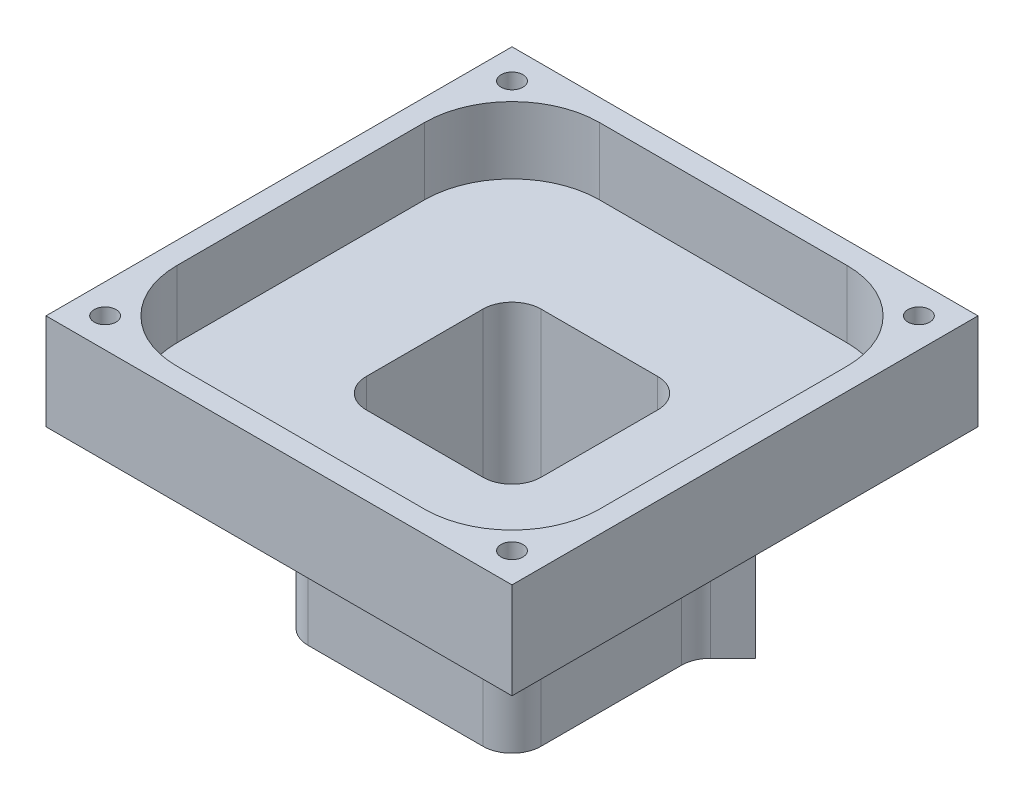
ISO-10303-21;
HEADER;
FILE_DESCRIPTION(('STEP AP214'),'2;1');
FILE_NAME('part.step','',(''),(''),'','','');
FILE_SCHEMA(('AUTOMOTIVE_DESIGN { 1 0 10303 214 1 1 1 1 }'));
ENDSEC;
DATA;
#1=APPLICATION_CONTEXT('core data for automotive mechanical design processes');
#2=APPLICATION_PROTOCOL_DEFINITION('international standard','automotive_design',2000,#1);
#3=PRODUCT_CONTEXT('',#1,'mechanical');
#4=PRODUCT('Part','Part','',(#3));
#5=PRODUCT_RELATED_PRODUCT_CATEGORY('part','',(#4));
#6=PRODUCT_DEFINITION_FORMATION('','',#4);
#7=PRODUCT_DEFINITION_CONTEXT('part definition',#1,'design');
#8=PRODUCT_DEFINITION('design','',#6,#7);
#9=PRODUCT_DEFINITION_SHAPE('','',#8);
#10=(LENGTH_UNIT() NAMED_UNIT(*) SI_UNIT(.MILLI.,.METRE.));
#11=(NAMED_UNIT(*) PLANE_ANGLE_UNIT() SI_UNIT($,.RADIAN.));
#12=(NAMED_UNIT(*) SI_UNIT($,.STERADIAN.) SOLID_ANGLE_UNIT());
#13=UNCERTAINTY_MEASURE_WITH_UNIT(LENGTH_MEASURE(1.E-05),#10,'distance_accuracy_value','');
#14=(GEOMETRIC_REPRESENTATION_CONTEXT(3) GLOBAL_UNCERTAINTY_ASSIGNED_CONTEXT((#13)) GLOBAL_UNIT_ASSIGNED_CONTEXT((#10,
#11,#12)) REPRESENTATION_CONTEXT('',''));
#15=CARTESIAN_POINT('',(0.,0.,0.));
#16=DIRECTION('',(0.,0.,1.));
#17=DIRECTION('',(1.,0.,0.));
#18=AXIS2_PLACEMENT_3D('',#15,#16,#17);
#19=CARTESIAN_POINT('',(4.,6.,-4.));
#20=DIRECTION('',(-1.,0.,0.));
#21=DIRECTION('',(0.,0.,1.));
#22=AXIS2_PLACEMENT_3D('',#19,#20,#21);
#23=PLANE('',#22);
#24=DIRECTION('',(0.,0.,-1.));
#25=VECTOR('',#24,1.);
#26=CARTESIAN_POINT('',(4.,6.,-4.));
#27=LINE('',#26,#25);
#28=CARTESIAN_POINT('',(4.,6.,3.));
#29=VERTEX_POINT('',#28);
#30=CARTESIAN_POINT('',(4.,6.,-1.81801948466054));
#31=VERTEX_POINT('',#30);
#32=EDGE_CURVE('E387',#29,#31,#27,.T.);
#33=ORIENTED_EDGE('',*,*,#32,.F.);
#34=DIRECTION('',(0.,-1.,0.));
#35=VECTOR('',#34,1.);
#36=CARTESIAN_POINT('',(4.,6.,3.));
#37=LINE('',#36,#35);
#38=CARTESIAN_POINT('',(4.,0.,3.));
#39=VERTEX_POINT('',#38);
#40=EDGE_CURVE('E495',#29,#39,#37,.T.);
#41=ORIENTED_EDGE('',*,*,#40,.T.);
#42=DIRECTION('',(0.,0.,-1.));
#43=VECTOR('',#42,1.);
#44=CARTESIAN_POINT('',(4.,0.,-4.));
#45=LINE('',#44,#43);
#46=CARTESIAN_POINT('',(4.,0.,-1.81801948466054));
#47=VERTEX_POINT('',#46);
#48=EDGE_CURVE('E386',#39,#47,#45,.T.);
#49=ORIENTED_EDGE('',*,*,#48,.T.);
#50=DIRECTION('',(0.,-1.,0.));
#51=VECTOR('',#50,1.);
#52=CARTESIAN_POINT('',(4.,6.,-1.81801948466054));
#53=LINE('',#52,#51);
#54=EDGE_CURVE('E480',#47,#31,#53,.F.);
#55=ORIENTED_EDGE('',*,*,#54,.T.);
#56=EDGE_LOOP('',(#33,#41,#49,#55));
#57=FACE_BOUND('',#56,.T.);
#58=ADVANCED_FACE('F35',(#57),#23,.F.);
#59=CARTESIAN_POINT('',(-4.,6.,-4.));
#60=DIRECTION('',(0.,0.,1.));
#61=DIRECTION('',(1.,0.,0.));
#62=AXIS2_PLACEMENT_3D('',#59,#60,#61);
#63=PLANE('',#62);
#64=DIRECTION('',(-1.,0.,0.));
#65=VECTOR('',#64,1.);
#66=CARTESIAN_POINT('',(-4.,0.,-4.));
#67=LINE('',#66,#65);
#68=CARTESIAN_POINT('',(1.81801948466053,0.,-4.));
#69=VERTEX_POINT('',#68);
#70=CARTESIAN_POINT('',(-3.,0.,-4.));
#71=VERTEX_POINT('',#70);
#72=EDGE_CURVE('E399',#69,#71,#67,.T.);
#73=ORIENTED_EDGE('',*,*,#72,.T.);
#74=DIRECTION('',(0.,-1.,0.));
#75=VECTOR('',#74,1.);
#76=CARTESIAN_POINT('',(-3.,6.,-4.));
#77=LINE('',#76,#75);
#78=CARTESIAN_POINT('',(-3.,6.,-4.));
#79=VERTEX_POINT('',#78);
#80=EDGE_CURVE('E50',#71,#79,#77,.F.);
#81=ORIENTED_EDGE('',*,*,#80,.T.);
#82=DIRECTION('',(-1.,0.,0.));
#83=VECTOR('',#82,1.);
#84=CARTESIAN_POINT('',(-4.,6.,-4.));
#85=LINE('',#84,#83);
#86=CARTESIAN_POINT('',(1.81801948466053,6.,-4.));
#87=VERTEX_POINT('',#86);
#88=EDGE_CURVE('E389',#87,#79,#85,.T.);
#89=ORIENTED_EDGE('',*,*,#88,.F.);
#90=DIRECTION('',(0.,-1.,0.));
#91=VECTOR('',#90,1.);
#92=CARTESIAN_POINT('',(1.81801948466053,6.,-4.));
#93=LINE('',#92,#91);
#94=EDGE_CURVE('E487',#87,#69,#93,.T.);
#95=ORIENTED_EDGE('',*,*,#94,.T.);
#96=EDGE_LOOP('',(#73,#81,#89,#95));
#97=FACE_BOUND('',#96,.T.);
#98=ADVANCED_FACE('F615',(#97),#63,.F.);
#99=CARTESIAN_POINT('',(-4.,6.,-4.));
#100=DIRECTION('',(1.,0.,0.));
#101=DIRECTION('',(0.,0.,-1.));
#102=AXIS2_PLACEMENT_3D('',#99,#100,#101);
#103=PLANE('',#102);
#104=DIRECTION('',(0.,0.,1.));
#105=VECTOR('',#104,1.);
#106=CARTESIAN_POINT('',(-4.,0.,-4.));
#107=LINE('',#106,#105);
#108=CARTESIAN_POINT('',(-4.,0.,-3.));
#109=VERTEX_POINT('',#108);
#110=CARTESIAN_POINT('',(-4.,0.,3.));
#111=VERTEX_POINT('',#110);
#112=EDGE_CURVE('E401',#109,#111,#107,.T.);
#113=ORIENTED_EDGE('',*,*,#112,.T.);
#114=DIRECTION('',(0.,-1.,0.));
#115=VECTOR('',#114,1.);
#116=CARTESIAN_POINT('',(-4.,6.,3.));
#117=LINE('',#116,#115);
#118=CARTESIAN_POINT('',(-4.,6.,3.));
#119=VERTEX_POINT('',#118);
#120=EDGE_CURVE('E58',#111,#119,#117,.F.);
#121=ORIENTED_EDGE('',*,*,#120,.T.);
#122=DIRECTION('',(0.,0.,1.));
#123=VECTOR('',#122,1.);
#124=CARTESIAN_POINT('',(-4.,6.,-4.));
#125=LINE('',#124,#123);
#126=CARTESIAN_POINT('',(-4.,6.,-3.));
#127=VERTEX_POINT('',#126);
#128=EDGE_CURVE('E392',#127,#119,#125,.T.);
#129=ORIENTED_EDGE('',*,*,#128,.F.);
#130=DIRECTION('',(0.,-1.,0.));
#131=VECTOR('',#130,1.);
#132=CARTESIAN_POINT('',(-4.,6.,-3.));
#133=LINE('',#132,#131);
#134=EDGE_CURVE('E730',#127,#109,#133,.T.);
#135=ORIENTED_EDGE('',*,*,#134,.T.);
#136=EDGE_LOOP('',(#113,#121,#129,#135));
#137=FACE_BOUND('',#136,.T.);
#138=ADVANCED_FACE('F611',(#137),#103,.F.);
#139=CARTESIAN_POINT('',(-4.,6.,4.));
#140=DIRECTION('',(0.,0.,-1.));
#141=DIRECTION('',(-1.,0.,0.));
#142=AXIS2_PLACEMENT_3D('',#139,#140,#141);
#143=PLANE('',#142);
#144=DIRECTION('',(1.,0.,0.));
#145=VECTOR('',#144,1.);
#146=CARTESIAN_POINT('',(-4.,0.,4.));
#147=LINE('',#146,#145);
#148=CARTESIAN_POINT('',(-3.,0.,4.));
#149=VERTEX_POINT('',#148);
#150=CARTESIAN_POINT('',(3.,0.,4.));
#151=VERTEX_POINT('',#150);
#152=EDGE_CURVE('E390',#149,#151,#147,.T.);
#153=ORIENTED_EDGE('',*,*,#152,.T.);
#154=DIRECTION('',(0.,-1.,0.));
#155=VECTOR('',#154,1.);
#156=CARTESIAN_POINT('',(3.,6.,4.));
#157=LINE('',#156,#155);
#158=CARTESIAN_POINT('',(3.,6.,4.));
#159=VERTEX_POINT('',#158);
#160=EDGE_CURVE('E733',#151,#159,#157,.F.);
#161=ORIENTED_EDGE('',*,*,#160,.T.);
#162=DIRECTION('',(1.,0.,0.));
#163=VECTOR('',#162,1.);
#164=CARTESIAN_POINT('',(-4.,6.,4.));
#165=LINE('',#164,#163);
#166=CARTESIAN_POINT('',(-3.,6.,4.));
#167=VERTEX_POINT('',#166);
#168=EDGE_CURVE('E394',#167,#159,#165,.T.);
#169=ORIENTED_EDGE('',*,*,#168,.F.);
#170=DIRECTION('',(0.,-1.,0.));
#171=VECTOR('',#170,1.);
#172=CARTESIAN_POINT('',(-3.,6.,4.));
#173=LINE('',#172,#171);
#174=EDGE_CURVE('E723',#167,#149,#173,.T.);
#175=ORIENTED_EDGE('',*,*,#174,.T.);
#176=EDGE_LOOP('',(#153,#161,#169,#175));
#177=FACE_BOUND('',#176,.T.);
#178=ADVANCED_FACE('F607',(#177),#143,.F.);
#179=CARTESIAN_POINT('',(0.,0.,0.));
#180=DIRECTION('',(0.,1.,0.));
#181=DIRECTION('',(0.,0.,1.));
#182=AXIS2_PLACEMENT_3D('',#179,#180,#181);
#183=PLANE('',#182);
#184=DIRECTION('',(-1.,0.,0.));
#185=VECTOR('',#184,1.);
#186=CARTESIAN_POINT('',(-3.,0.,3.));
#187=LINE('',#186,#185);
#188=CARTESIAN_POINT('',(2.,0.,3.));
#189=VERTEX_POINT('',#188);
#190=CARTESIAN_POINT('',(-2.,0.,3.));
#191=VERTEX_POINT('',#190);
#192=EDGE_CURVE('E347',#189,#191,#187,.T.);
#193=ORIENTED_EDGE('',*,*,#192,.F.);
#194=CARTESIAN_POINT('',(2.,0.,2.));
#195=DIRECTION('',(0.,1.,0.));
#196=DIRECTION('',(0.,0.,1.));
#197=AXIS2_PLACEMENT_3D('',#194,#195,#196);
#198=CIRCLE('',#197,1.);
#199=CARTESIAN_POINT('',(3.,0.,2.));
#200=VERTEX_POINT('',#199);
#201=EDGE_CURVE('E475',#189,#200,#198,.T.);
#202=ORIENTED_EDGE('',*,*,#201,.T.);
#203=DIRECTION('',(0.,0.,1.));
#204=VECTOR('',#203,1.);
#205=CARTESIAN_POINT('',(3.,0.,-3.));
#206=LINE('',#205,#204);
#207=CARTESIAN_POINT('',(3.,0.,-2.));
#208=VERTEX_POINT('',#207);
#209=EDGE_CURVE('E344',#208,#200,#206,.T.);
#210=ORIENTED_EDGE('',*,*,#209,.F.);
#211=CARTESIAN_POINT('',(2.,0.,-2.));
#212=DIRECTION('',(0.,1.,0.));
#213=DIRECTION('',(0.,0.,1.));
#214=AXIS2_PLACEMENT_3D('',#211,#212,#213);
#215=CIRCLE('',#214,1.);
#216=CARTESIAN_POINT('',(2.,0.,-3.));
#217=VERTEX_POINT('',#216);
#218=EDGE_CURVE('E463',#208,#217,#215,.T.);
#219=ORIENTED_EDGE('',*,*,#218,.T.);
#220=DIRECTION('',(1.,0.,0.));
#221=VECTOR('',#220,1.);
#222=CARTESIAN_POINT('',(-3.,0.,-3.));
#223=LINE('',#222,#221);
#224=CARTESIAN_POINT('',(-2.,0.,-3.));
#225=VERTEX_POINT('',#224);
#226=EDGE_CURVE('E353',#225,#217,#223,.T.);
#227=ORIENTED_EDGE('',*,*,#226,.F.);
#228=CARTESIAN_POINT('',(-2.,0.,-2.));
#229=DIRECTION('',(0.,1.,0.));
#230=DIRECTION('',(0.,0.,1.));
#231=AXIS2_PLACEMENT_3D('',#228,#229,#230);
#232=CIRCLE('',#231,1.);
#233=CARTESIAN_POINT('',(-3.,0.,-2.));
#234=VERTEX_POINT('',#233);
#235=EDGE_CURVE('E467',#225,#234,#232,.T.);
#236=ORIENTED_EDGE('',*,*,#235,.T.);
#237=DIRECTION('',(0.,0.,-1.));
#238=VECTOR('',#237,1.);
#239=CARTESIAN_POINT('',(-3.,0.,-3.));
#240=LINE('',#239,#238);
#241=CARTESIAN_POINT('',(-3.,0.,2.));
#242=VERTEX_POINT('',#241);
#243=EDGE_CURVE('E350',#242,#234,#240,.T.);
#244=ORIENTED_EDGE('',*,*,#243,.F.);
#245=CARTESIAN_POINT('',(-2.,0.,2.));
#246=DIRECTION('',(0.,1.,0.));
#247=DIRECTION('',(0.,0.,1.));
#248=AXIS2_PLACEMENT_3D('',#245,#246,#247);
#249=CIRCLE('',#248,1.);
#250=EDGE_CURVE('E471',#242,#191,#249,.T.);
#251=ORIENTED_EDGE('',*,*,#250,.T.);
#252=EDGE_LOOP('',(#193,#202,#210,#219,#227,#236,#244,#251));
#253=FACE_BOUND('',#252,.T.);
#254=ORIENTED_EDGE('',*,*,#48,.F.);
#255=CARTESIAN_POINT('',(3.,0.,3.));
#256=DIRECTION('',(0.,1.,0.));
#257=DIRECTION('',(0.,0.,1.));
#258=AXIS2_PLACEMENT_3D('',#255,#256,#257);
#259=CIRCLE('',#258,1.);
#260=EDGE_CURVE('E736',#39,#151,#259,.F.);
#261=ORIENTED_EDGE('',*,*,#260,.T.);
#262=ORIENTED_EDGE('',*,*,#152,.F.);
#263=CARTESIAN_POINT('',(-3.,0.,3.));
#264=DIRECTION('',(0.,1.,0.));
#265=DIRECTION('',(0.,0.,1.));
#266=AXIS2_PLACEMENT_3D('',#263,#264,#265);
#267=CIRCLE('',#266,1.);
#268=EDGE_CURVE('E738',#149,#111,#267,.F.);
#269=ORIENTED_EDGE('',*,*,#268,.T.);
#270=ORIENTED_EDGE('',*,*,#112,.F.);
#271=CARTESIAN_POINT('',(-3.,0.,-3.));
#272=DIRECTION('',(0.,1.,0.));
#273=DIRECTION('',(0.,0.,1.));
#274=AXIS2_PLACEMENT_3D('',#271,#272,#273);
#275=CIRCLE('',#274,1.);
#276=EDGE_CURVE('E740',#109,#71,#275,.F.);
#277=ORIENTED_EDGE('',*,*,#276,.T.);
#278=ORIENTED_EDGE('',*,*,#72,.F.);
#279=CARTESIAN_POINT('',(1.81801948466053,0.,-5.));
#280=DIRECTION('',(0.,1.,0.));
#281=DIRECTION('',(0.,0.,1.));
#282=AXIS2_PLACEMENT_3D('',#279,#280,#281);
#283=CIRCLE('',#282,1.);
#284=CARTESIAN_POINT('',(2.52512626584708,0.,-4.29289321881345));
#285=VERTEX_POINT('',#284);
#286=EDGE_CURVE('E494',#69,#285,#283,.T.);
#287=ORIENTED_EDGE('',*,*,#286,.T.);
#288=DIRECTION('',(0.707106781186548,0.,-0.707106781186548));
#289=VECTOR('',#288,1.);
#290=CARTESIAN_POINT('',(2.23223304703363,0.,-4.));
#291=LINE('',#290,#289);
#292=CARTESIAN_POINT('',(3.29289321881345,0.,-5.06066017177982));
#293=VERTEX_POINT('',#292);
#294=EDGE_CURVE('E267',#285,#293,#291,.T.);
#295=ORIENTED_EDGE('',*,*,#294,.T.);
#296=DIRECTION('',(0.707106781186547,0.,0.707106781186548));
#297=VECTOR('',#296,1.);
#298=CARTESIAN_POINT('',(3.29289321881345,0.,-5.06066017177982));
#299=LINE('',#298,#297);
#300=CARTESIAN_POINT('',(5.06066017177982,0.,-3.29289321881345));
#301=VERTEX_POINT('',#300);
#302=EDGE_CURVE('E253',#293,#301,#299,.T.);
#303=ORIENTED_EDGE('',*,*,#302,.T.);
#304=DIRECTION('',(-0.707106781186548,0.,0.707106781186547));
#305=VECTOR('',#304,1.);
#306=CARTESIAN_POINT('',(5.06066017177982,0.,-3.29289321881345));
#307=LINE('',#306,#305);
#308=CARTESIAN_POINT('',(4.29289321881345,0.,-2.52512626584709));
#309=VERTEX_POINT('',#308);
#310=EDGE_CURVE('E261',#301,#309,#307,.T.);
#311=ORIENTED_EDGE('',*,*,#310,.T.);
#312=CARTESIAN_POINT('',(5.,0.,-1.81801948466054));
#313=DIRECTION('',(0.,1.,0.));
#314=DIRECTION('',(0.,0.,1.));
#315=AXIS2_PLACEMENT_3D('',#312,#313,#314);
#316=CIRCLE('',#315,1.);
#317=EDGE_CURVE('E492',#309,#47,#316,.T.);
#318=ORIENTED_EDGE('',*,*,#317,.T.);
#319=EDGE_LOOP('',(#254,#261,#262,#269,#270,#277,#278,#287,#295,#303,#311,#318));
#320=FACE_BOUND('',#319,.T.);
#321=ADVANCED_FACE('F270',(#253,#320),#183,.F.);
#322=CARTESIAN_POINT('',(0.,6.,0.));
#323=DIRECTION('',(0.,-1.,0.));
#324=DIRECTION('',(0.,0.,-1.));
#325=AXIS2_PLACEMENT_3D('',#322,#323,#324);
#326=PLANE('',#325);
#327=ORIENTED_EDGE('',*,*,#168,.T.);
#328=CARTESIAN_POINT('',(3.,6.,3.));
#329=DIRECTION('',(0.,-1.,0.));
#330=DIRECTION('',(0.,0.,-1.));
#331=AXIS2_PLACEMENT_3D('',#328,#329,#330);
#332=CIRCLE('',#331,1.);
#333=EDGE_CURVE('E725',#159,#29,#332,.F.);
#334=ORIENTED_EDGE('',*,*,#333,.T.);
#335=ORIENTED_EDGE('',*,*,#32,.T.);
#336=CARTESIAN_POINT('',(5.,5.99999999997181,-1.81801948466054));
#337=DIRECTION('',(0.,-1.,0.));
#338=DIRECTION('',(0.,0.,-1.));
#339=AXIS2_PLACEMENT_3D('',#336,#337,#338);
#340=CIRCLE('',#339,1.);
#341=CARTESIAN_POINT('',(4.29289321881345,5.99999999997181,-2.52512626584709));
#342=VERTEX_POINT('',#341);
#343=EDGE_CURVE('E485',#31,#342,#340,.T.);
#344=ORIENTED_EDGE('',*,*,#343,.T.);
#345=DIRECTION('',(0.707106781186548,0.,-0.707106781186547));
#346=VECTOR('',#345,1.);
#347=CARTESIAN_POINT('',(5.06066017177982,5.99999999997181,-3.29289321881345));
#348=LINE('',#347,#346);
#349=CARTESIAN_POINT('',(5.06066017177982,6.,-3.29289321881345));
#350=VERTEX_POINT('',#349);
#351=EDGE_CURVE('E285',#342,#350,#348,.T.);
#352=ORIENTED_EDGE('',*,*,#351,.T.);
#353=DIRECTION('',(-0.707106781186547,0.,-0.707106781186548));
#354=VECTOR('',#353,1.);
#355=CARTESIAN_POINT('',(3.29289321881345,5.99999999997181,-5.06066017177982));
#356=LINE('',#355,#354);
#357=CARTESIAN_POINT('',(3.29289321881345,6.00000000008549,-5.06066017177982));
#358=VERTEX_POINT('',#357);
#359=EDGE_CURVE('E254',#350,#358,#356,.T.);
#360=ORIENTED_EDGE('',*,*,#359,.T.);
#361=DIRECTION('',(-0.707106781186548,0.,0.707106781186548));
#362=VECTOR('',#361,1.);
#363=CARTESIAN_POINT('',(2.23223304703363,5.99999999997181,-4.));
#364=LINE('',#363,#362);
#365=CARTESIAN_POINT('',(2.52512626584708,5.99999999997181,-4.29289321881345));
#366=VERTEX_POINT('',#365);
#367=EDGE_CURVE('E281',#358,#366,#364,.T.);
#368=ORIENTED_EDGE('',*,*,#367,.T.);
#369=CARTESIAN_POINT('',(1.81801948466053,6.,-5.));
#370=DIRECTION('',(0.,-1.,0.));
#371=DIRECTION('',(0.,0.,-1.));
#372=AXIS2_PLACEMENT_3D('',#369,#370,#371);
#373=CIRCLE('',#372,1.);
#374=EDGE_CURVE('E483',#366,#87,#373,.T.);
#375=ORIENTED_EDGE('',*,*,#374,.T.);
#376=ORIENTED_EDGE('',*,*,#88,.T.);
#377=CARTESIAN_POINT('',(-3.,6.,-3.));
#378=DIRECTION('',(0.,-1.,0.));
#379=DIRECTION('',(0.,0.,-1.));
#380=AXIS2_PLACEMENT_3D('',#377,#378,#379);
#381=CIRCLE('',#380,1.);
#382=EDGE_CURVE('E11',#79,#127,#381,.F.);
#383=ORIENTED_EDGE('',*,*,#382,.T.);
#384=ORIENTED_EDGE('',*,*,#128,.T.);
#385=CARTESIAN_POINT('',(-3.,6.,3.));
#386=DIRECTION('',(0.,-1.,0.));
#387=DIRECTION('',(0.,0.,-1.));
#388=AXIS2_PLACEMENT_3D('',#385,#386,#387);
#389=CIRCLE('',#388,1.);
#390=EDGE_CURVE('E43',#119,#167,#389,.F.);
#391=ORIENTED_EDGE('',*,*,#390,.T.);
#392=EDGE_LOOP('',(#327,#334,#335,#344,#352,#360,#368,#375,#376,#383,#384,#391));
#393=FACE_BOUND('',#392,.T.);
#394=CARTESIAN_POINT('',(-6.985,6.,6.985));
#395=DIRECTION('',(0.,-1.,0.));
#396=DIRECTION('',(0.,0.,-1.));
#397=AXIS2_PLACEMENT_3D('',#394,#395,#396);
#398=CIRCLE('',#397,0.374999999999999);
#399=CARTESIAN_POINT('',(-6.985,6.,6.61));
#400=VERTEX_POINT('',#399);
#401=EDGE_CURVE('E290',#400,#400,#398,.T.);
#402=ORIENTED_EDGE('',*,*,#401,.F.);
#403=EDGE_LOOP('',(#402));
#404=FACE_BOUND('',#403,.T.);
#405=CARTESIAN_POINT('',(-6.985,6.,-6.985));
#406=DIRECTION('',(0.,-1.,0.));
#407=DIRECTION('',(0.,0.,-1.));
#408=AXIS2_PLACEMENT_3D('',#405,#406,#407);
#409=CIRCLE('',#408,0.374999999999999);
#410=CARTESIAN_POINT('',(-6.985,6.,-7.36));
#411=VERTEX_POINT('',#410);
#412=EDGE_CURVE('E296',#411,#411,#409,.T.);
#413=ORIENTED_EDGE('',*,*,#412,.F.);
#414=EDGE_LOOP('',(#413));
#415=FACE_BOUND('',#414,.T.);
#416=CARTESIAN_POINT('',(6.985,6.,-6.985));
#417=DIRECTION('',(0.,-1.,0.));
#418=DIRECTION('',(0.,0.,-1.));
#419=AXIS2_PLACEMENT_3D('',#416,#417,#418);
#420=CIRCLE('',#419,0.374999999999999);
#421=CARTESIAN_POINT('',(6.985,6.,-7.36));
#422=VERTEX_POINT('',#421);
#423=EDGE_CURVE('E302',#422,#422,#420,.T.);
#424=ORIENTED_EDGE('',*,*,#423,.F.);
#425=EDGE_LOOP('',(#424));
#426=FACE_BOUND('',#425,.T.);
#427=CARTESIAN_POINT('',(6.985,6.,6.985));
#428=DIRECTION('',(0.,-1.,0.));
#429=DIRECTION('',(0.,0.,-1.));
#430=AXIS2_PLACEMENT_3D('',#427,#428,#429);
#431=CIRCLE('',#430,0.374999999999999);
#432=CARTESIAN_POINT('',(6.985,6.,6.61));
#433=VERTEX_POINT('',#432);
#434=EDGE_CURVE('E308',#433,#433,#431,.T.);
#435=ORIENTED_EDGE('',*,*,#434,.F.);
#436=EDGE_LOOP('',(#435));
#437=FACE_BOUND('',#436,.T.);
#438=DIRECTION('',(0.,0.,1.));
#439=VECTOR('',#438,1.);
#440=CARTESIAN_POINT('',(-8.,6.,-8.));
#441=LINE('',#440,#439);
#442=CARTESIAN_POINT('',(-8.,6.,-8.));
#443=VERTEX_POINT('',#442);
#444=CARTESIAN_POINT('',(-8.,6.,8.));
#445=VERTEX_POINT('',#444);
#446=EDGE_CURVE('E356',#443,#445,#441,.T.);
#447=ORIENTED_EDGE('',*,*,#446,.F.);
#448=DIRECTION('',(-1.,0.,0.));
#449=VECTOR('',#448,1.);
#450=CARTESIAN_POINT('',(8.,6.,-8.));
#451=LINE('',#450,#449);
#452=CARTESIAN_POINT('',(8.,6.,-8.));
#453=VERTEX_POINT('',#452);
#454=EDGE_CURVE('E361',#453,#443,#451,.T.);
#455=ORIENTED_EDGE('',*,*,#454,.F.);
#456=DIRECTION('',(0.,0.,-1.));
#457=VECTOR('',#456,1.);
#458=CARTESIAN_POINT('',(8.,6.,-8.));
#459=LINE('',#458,#457);
#460=CARTESIAN_POINT('',(8.,6.,8.));
#461=VERTEX_POINT('',#460);
#462=EDGE_CURVE('E372',#461,#453,#459,.T.);
#463=ORIENTED_EDGE('',*,*,#462,.F.);
#464=DIRECTION('',(1.,0.,0.));
#465=VECTOR('',#464,1.);
#466=CARTESIAN_POINT('',(8.,6.,8.));
#467=LINE('',#466,#465);
#468=EDGE_CURVE('E370',#445,#461,#467,.T.);
#469=ORIENTED_EDGE('',*,*,#468,.F.);
#470=EDGE_LOOP('',(#447,#455,#463,#469));
#471=FACE_BOUND('',#470,.T.);
#472=ADVANCED_FACE('F586',(#393,#404,#415,#426,#437,#471),#326,.T.);
#473=CARTESIAN_POINT('',(-8.,9.3,-8.));
#474=DIRECTION('',(1.,0.,0.));
#475=DIRECTION('',(0.,0.,-1.));
#476=AXIS2_PLACEMENT_3D('',#473,#474,#475);
#477=PLANE('',#476);
#478=ORIENTED_EDGE('',*,*,#446,.T.);
#479=DIRECTION('',(0.,-1.,0.));
#480=VECTOR('',#479,1.);
#481=CARTESIAN_POINT('',(-8.,9.3,8.));
#482=LINE('',#481,#480);
#483=CARTESIAN_POINT('',(-8.,9.3,8.));
#484=VERTEX_POINT('',#483);
#485=EDGE_CURVE('E383',#484,#445,#482,.T.);
#486=ORIENTED_EDGE('',*,*,#485,.F.);
#487=DIRECTION('',(0.,0.,1.));
#488=VECTOR('',#487,1.);
#489=CARTESIAN_POINT('',(-8.,9.3,-8.));
#490=LINE('',#489,#488);
#491=CARTESIAN_POINT('',(-8.,9.3,-8.));
#492=VERTEX_POINT('',#491);
#493=EDGE_CURVE('E357',#492,#484,#490,.T.);
#494=ORIENTED_EDGE('',*,*,#493,.F.);
#495=DIRECTION('',(0.,-1.,0.));
#496=VECTOR('',#495,1.);
#497=CARTESIAN_POINT('',(-8.,9.3,-8.));
#498=LINE('',#497,#496);
#499=EDGE_CURVE('E367',#492,#443,#498,.T.);
#500=ORIENTED_EDGE('',*,*,#499,.T.);
#501=EDGE_LOOP('',(#478,#486,#494,#500));
#502=FACE_BOUND('',#501,.T.);
#503=ADVANCED_FACE('F589',(#502),#477,.F.);
#504=CARTESIAN_POINT('',(8.,9.3,8.));
#505=DIRECTION('',(0.,0.,-1.));
#506=DIRECTION('',(-1.,0.,0.));
#507=AXIS2_PLACEMENT_3D('',#504,#505,#506);
#508=PLANE('',#507);
#509=ORIENTED_EDGE('',*,*,#468,.T.);
#510=DIRECTION('',(0.,-1.,0.));
#511=VECTOR('',#510,1.);
#512=CARTESIAN_POINT('',(8.,9.3,8.));
#513=LINE('',#512,#511);
#514=CARTESIAN_POINT('',(8.,9.3,8.));
#515=VERTEX_POINT('',#514);
#516=EDGE_CURVE('E380',#515,#461,#513,.T.);
#517=ORIENTED_EDGE('',*,*,#516,.F.);
#518=DIRECTION('',(1.,0.,0.));
#519=VECTOR('',#518,1.);
#520=CARTESIAN_POINT('',(8.,9.3,8.));
#521=LINE('',#520,#519);
#522=EDGE_CURVE('E360',#484,#515,#521,.T.);
#523=ORIENTED_EDGE('',*,*,#522,.F.);
#524=ORIENTED_EDGE('',*,*,#485,.T.);
#525=EDGE_LOOP('',(#509,#517,#523,#524));
#526=FACE_BOUND('',#525,.T.);
#527=ADVANCED_FACE('F597',(#526),#508,.F.);
#528=CARTESIAN_POINT('',(8.,9.3,-8.));
#529=DIRECTION('',(-1.,0.,0.));
#530=DIRECTION('',(0.,0.,1.));
#531=AXIS2_PLACEMENT_3D('',#528,#529,#530);
#532=PLANE('',#531);
#533=ORIENTED_EDGE('',*,*,#462,.T.);
#534=DIRECTION('',(0.,-1.,0.));
#535=VECTOR('',#534,1.);
#536=CARTESIAN_POINT('',(8.,9.3,-8.));
#537=LINE('',#536,#535);
#538=CARTESIAN_POINT('',(8.,9.3,-8.));
#539=VERTEX_POINT('',#538);
#540=EDGE_CURVE('E377',#539,#453,#537,.T.);
#541=ORIENTED_EDGE('',*,*,#540,.F.);
#542=DIRECTION('',(0.,0.,-1.));
#543=VECTOR('',#542,1.);
#544=CARTESIAN_POINT('',(8.,9.3,-8.));
#545=LINE('',#544,#543);
#546=EDGE_CURVE('E363',#515,#539,#545,.T.);
#547=ORIENTED_EDGE('',*,*,#546,.F.);
#548=ORIENTED_EDGE('',*,*,#516,.T.);
#549=EDGE_LOOP('',(#533,#541,#547,#548));
#550=FACE_BOUND('',#549,.T.);
#551=ADVANCED_FACE('F593',(#550),#532,.F.);
#552=CARTESIAN_POINT('',(8.,9.3,-8.));
#553=DIRECTION('',(0.,0.,1.));
#554=DIRECTION('',(1.,0.,0.));
#555=AXIS2_PLACEMENT_3D('',#552,#553,#554);
#556=PLANE('',#555);
#557=ORIENTED_EDGE('',*,*,#454,.T.);
#558=ORIENTED_EDGE('',*,*,#499,.F.);
#559=DIRECTION('',(-1.,0.,0.));
#560=VECTOR('',#559,1.);
#561=CARTESIAN_POINT('',(8.,9.3,-8.));
#562=LINE('',#561,#560);
#563=EDGE_CURVE('E365',#539,#492,#562,.T.);
#564=ORIENTED_EDGE('',*,*,#563,.F.);
#565=ORIENTED_EDGE('',*,*,#540,.T.);
#566=EDGE_LOOP('',(#557,#558,#564,#565));
#567=FACE_BOUND('',#566,.T.);
#568=ADVANCED_FACE('F584',(#567),#556,.F.);
#569=CARTESIAN_POINT('',(0.,9.3,0.));
#570=DIRECTION('',(0.,-1.,0.));
#571=DIRECTION('',(0.,0.,-1.));
#572=AXIS2_PLACEMENT_3D('',#569,#570,#571);
#573=PLANE('',#572);
#574=CARTESIAN_POINT('',(-6.985,9.3,6.985));
#575=DIRECTION('',(0.,1.,0.));
#576=DIRECTION('',(0.,0.,1.));
#577=AXIS2_PLACEMENT_3D('',#574,#575,#576);
#578=CIRCLE('',#577,0.374999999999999);
#579=CARTESIAN_POINT('',(-6.985,9.3,7.36));
#580=VERTEX_POINT('',#579);
#581=EDGE_CURVE('E284',#580,#580,#578,.T.);
#582=ORIENTED_EDGE('',*,*,#581,.F.);
#583=EDGE_LOOP('',(#582));
#584=FACE_BOUND('',#583,.T.);
#585=CARTESIAN_POINT('',(-6.985,9.3,-6.985));
#586=DIRECTION('',(0.,1.,0.));
#587=DIRECTION('',(0.,0.,1.));
#588=AXIS2_PLACEMENT_3D('',#585,#586,#587);
#589=CIRCLE('',#588,0.374999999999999);
#590=CARTESIAN_POINT('',(-6.985,9.3,-6.61));
#591=VERTEX_POINT('',#590);
#592=EDGE_CURVE('E293',#591,#591,#589,.T.);
#593=ORIENTED_EDGE('',*,*,#592,.F.);
#594=EDGE_LOOP('',(#593));
#595=FACE_BOUND('',#594,.T.);
#596=CARTESIAN_POINT('',(6.985,9.3,-6.985));
#597=DIRECTION('',(0.,1.,0.));
#598=DIRECTION('',(0.,0.,1.));
#599=AXIS2_PLACEMENT_3D('',#596,#597,#598);
#600=CIRCLE('',#599,0.374999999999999);
#601=CARTESIAN_POINT('',(6.985,9.3,-6.61));
#602=VERTEX_POINT('',#601);
#603=EDGE_CURVE('E299',#602,#602,#600,.T.);
#604=ORIENTED_EDGE('',*,*,#603,.F.);
#605=EDGE_LOOP('',(#604));
#606=FACE_BOUND('',#605,.T.);
#607=CARTESIAN_POINT('',(6.985,9.3,6.985));
#608=DIRECTION('',(0.,1.,0.));
#609=DIRECTION('',(0.,0.,1.));
#610=AXIS2_PLACEMENT_3D('',#607,#608,#609);
#611=CIRCLE('',#610,0.374999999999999);
#612=CARTESIAN_POINT('',(6.985,9.3,7.36));
#613=VERTEX_POINT('',#612);
#614=EDGE_CURVE('E305',#613,#613,#611,.T.);
#615=ORIENTED_EDGE('',*,*,#614,.F.);
#616=EDGE_LOOP('',(#615));
#617=FACE_BOUND('',#616,.T.);
#618=DIRECTION('',(1.,0.,0.));
#619=VECTOR('',#618,1.);
#620=CARTESIAN_POINT('',(7.25,9.3,7.25));
#621=LINE('',#620,#619);
#622=CARTESIAN_POINT('',(-4.25,9.3,7.25));
#623=VERTEX_POINT('',#622);
#624=CARTESIAN_POINT('',(4.25,9.3,7.25));
#625=VERTEX_POINT('',#624);
#626=EDGE_CURVE('E328',#623,#625,#621,.T.);
#627=ORIENTED_EDGE('',*,*,#626,.F.);
#628=CARTESIAN_POINT('',(-4.25,9.3,4.25));
#629=DIRECTION('',(0.,-1.,0.));
#630=DIRECTION('',(0.,0.,-1.));
#631=AXIS2_PLACEMENT_3D('',#628,#629,#630);
#632=CIRCLE('',#631,3.);
#633=CARTESIAN_POINT('',(-7.25,9.3,4.25));
#634=VERTEX_POINT('',#633);
#635=EDGE_CURVE('E441',#623,#634,#632,.T.);
#636=ORIENTED_EDGE('',*,*,#635,.T.);
#637=DIRECTION('',(0.,0.,1.));
#638=VECTOR('',#637,1.);
#639=CARTESIAN_POINT('',(-7.25,9.3,-7.25));
#640=LINE('',#639,#638);
#641=CARTESIAN_POINT('',(-7.25,9.3,-4.25));
#642=VERTEX_POINT('',#641);
#643=EDGE_CURVE('E311',#642,#634,#640,.T.);
#644=ORIENTED_EDGE('',*,*,#643,.F.);
#645=CARTESIAN_POINT('',(-4.25,9.3,-4.25));
#646=DIRECTION('',(0.,-1.,0.));
#647=DIRECTION('',(0.,0.,-1.));
#648=AXIS2_PLACEMENT_3D('',#645,#646,#647);
#649=CIRCLE('',#648,3.);
#650=CARTESIAN_POINT('',(-4.25,9.3,-7.25));
#651=VERTEX_POINT('',#650);
#652=EDGE_CURVE('E435',#642,#651,#649,.T.);
#653=ORIENTED_EDGE('',*,*,#652,.T.);
#654=DIRECTION('',(-1.,0.,0.));
#655=VECTOR('',#654,1.);
#656=CARTESIAN_POINT('',(7.25,9.3,-7.25));
#657=LINE('',#656,#655);
#658=CARTESIAN_POINT('',(4.25,9.3,-7.25));
#659=VERTEX_POINT('',#658);
#660=EDGE_CURVE('E316',#659,#651,#657,.T.);
#661=ORIENTED_EDGE('',*,*,#660,.F.);
#662=CARTESIAN_POINT('',(4.25,9.3,-4.25));
#663=DIRECTION('',(0.,-1.,0.));
#664=DIRECTION('',(0.,0.,-1.));
#665=AXIS2_PLACEMENT_3D('',#662,#663,#664);
#666=CIRCLE('',#665,3.);
#667=CARTESIAN_POINT('',(7.25,9.3,-4.25));
#668=VERTEX_POINT('',#667);
#669=EDGE_CURVE('E437',#659,#668,#666,.T.);
#670=ORIENTED_EDGE('',*,*,#669,.T.);
#671=DIRECTION('',(0.,0.,-1.));
#672=VECTOR('',#671,1.);
#673=CARTESIAN_POINT('',(7.25,9.3,-7.25));
#674=LINE('',#673,#672);
#675=CARTESIAN_POINT('',(7.25,9.3,4.24999999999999));
#676=VERTEX_POINT('',#675);
#677=EDGE_CURVE('E331',#676,#668,#674,.T.);
#678=ORIENTED_EDGE('',*,*,#677,.F.);
#679=CARTESIAN_POINT('',(4.25,9.3,4.25));
#680=DIRECTION('',(0.,-1.,0.));
#681=DIRECTION('',(0.,0.,-1.));
#682=AXIS2_PLACEMENT_3D('',#679,#680,#681);
#683=CIRCLE('',#682,3.);
#684=EDGE_CURVE('E439',#676,#625,#683,.T.);
#685=ORIENTED_EDGE('',*,*,#684,.T.);
#686=EDGE_LOOP('',(#627,#636,#644,#653,#661,#670,#678,#685));
#687=FACE_BOUND('',#686,.T.);
#688=ORIENTED_EDGE('',*,*,#493,.T.);
#689=ORIENTED_EDGE('',*,*,#522,.T.);
#690=ORIENTED_EDGE('',*,*,#546,.T.);
#691=ORIENTED_EDGE('',*,*,#563,.T.);
#692=EDGE_LOOP('',(#688,#689,#690,#691));
#693=FACE_BOUND('',#692,.T.);
#694=ADVANCED_FACE('F580',(#584,#595,#606,#617,#687,#693),#573,.F.);
#695=CARTESIAN_POINT('',(3.,9.3,-3.));
#696=DIRECTION('',(1.,0.,0.));
#697=DIRECTION('',(0.,0.,-1.));
#698=AXIS2_PLACEMENT_3D('',#695,#696,#697);
#699=PLANE('',#698);
#700=DIRECTION('',(0.,0.,-1.));
#701=VECTOR('',#700,1.);
#702=CARTESIAN_POINT('',(3.,7.,-3.));
#703=LINE('',#702,#701);
#704=CARTESIAN_POINT('',(3.,7.,2.));
#705=VERTEX_POINT('',#704);
#706=CARTESIAN_POINT('',(3.,7.,-2.));
#707=VERTEX_POINT('',#706);
#708=EDGE_CURVE('E341',#705,#707,#703,.T.);
#709=ORIENTED_EDGE('',*,*,#708,.T.);
#710=DIRECTION('',(0.,-1.,0.));
#711=VECTOR('',#710,1.);
#712=CARTESIAN_POINT('',(3.,0.,-2.));
#713=LINE('',#712,#711);
#714=EDGE_CURVE('E445',#707,#208,#713,.T.);
#715=ORIENTED_EDGE('',*,*,#714,.T.);
#716=ORIENTED_EDGE('',*,*,#209,.T.);
#717=DIRECTION('',(0.,-1.,0.));
#718=VECTOR('',#717,1.);
#719=CARTESIAN_POINT('',(3.,7.,2.));
#720=LINE('',#719,#718);
#721=EDGE_CURVE('E443',#200,#705,#720,.F.);
#722=ORIENTED_EDGE('',*,*,#721,.T.);
#723=EDGE_LOOP('',(#709,#715,#716,#722));
#724=FACE_BOUND('',#723,.T.);
#725=ADVANCED_FACE('F570',(#724),#699,.F.);
#726=CARTESIAN_POINT('',(-3.,9.3,-3.));
#727=DIRECTION('',(0.,0.,-1.));
#728=DIRECTION('',(-1.,0.,0.));
#729=AXIS2_PLACEMENT_3D('',#726,#727,#728);
#730=PLANE('',#729);
#731=ORIENTED_EDGE('',*,*,#226,.T.);
#732=DIRECTION('',(0.,-1.,0.));
#733=VECTOR('',#732,1.);
#734=CARTESIAN_POINT('',(2.,7.,-3.));
#735=LINE('',#734,#733);
#736=CARTESIAN_POINT('',(2.,7.,-3.));
#737=VERTEX_POINT('',#736);
#738=EDGE_CURVE('E451',#217,#737,#735,.F.);
#739=ORIENTED_EDGE('',*,*,#738,.T.);
#740=DIRECTION('',(-1.,0.,0.));
#741=VECTOR('',#740,1.);
#742=CARTESIAN_POINT('',(-3.,7.,-3.));
#743=LINE('',#742,#741);
#744=CARTESIAN_POINT('',(-2.,7.,-3.));
#745=VERTEX_POINT('',#744);
#746=EDGE_CURVE('E338',#737,#745,#743,.T.);
#747=ORIENTED_EDGE('',*,*,#746,.T.);
#748=DIRECTION('',(0.,-1.,0.));
#749=VECTOR('',#748,1.);
#750=CARTESIAN_POINT('',(-2.,0.,-3.));
#751=LINE('',#750,#749);
#752=EDGE_CURVE('E448',#745,#225,#751,.T.);
#753=ORIENTED_EDGE('',*,*,#752,.T.);
#754=EDGE_LOOP('',(#731,#739,#747,#753));
#755=FACE_BOUND('',#754,.T.);
#756=ADVANCED_FACE('F566',(#755),#730,.F.);
#757=CARTESIAN_POINT('',(-3.,9.3,-3.));
#758=DIRECTION('',(-1.,0.,0.));
#759=DIRECTION('',(0.,0.,1.));
#760=AXIS2_PLACEMENT_3D('',#757,#758,#759);
#761=PLANE('',#760);
#762=ORIENTED_EDGE('',*,*,#243,.T.);
#763=DIRECTION('',(0.,-1.,0.));
#764=VECTOR('',#763,1.);
#765=CARTESIAN_POINT('',(-3.,7.,-2.));
#766=LINE('',#765,#764);
#767=CARTESIAN_POINT('',(-3.,7.,-2.));
#768=VERTEX_POINT('',#767);
#769=EDGE_CURVE('E456',#234,#768,#766,.F.);
#770=ORIENTED_EDGE('',*,*,#769,.T.);
#771=DIRECTION('',(0.,0.,1.));
#772=VECTOR('',#771,1.);
#773=CARTESIAN_POINT('',(-3.,7.,-3.));
#774=LINE('',#773,#772);
#775=CARTESIAN_POINT('',(-3.,7.,2.));
#776=VERTEX_POINT('',#775);
#777=EDGE_CURVE('E325',#768,#776,#774,.T.);
#778=ORIENTED_EDGE('',*,*,#777,.T.);
#779=DIRECTION('',(0.,-1.,0.));
#780=VECTOR('',#779,1.);
#781=CARTESIAN_POINT('',(-3.,0.,2.));
#782=LINE('',#781,#780);
#783=EDGE_CURVE('E453',#776,#242,#782,.T.);
#784=ORIENTED_EDGE('',*,*,#783,.T.);
#785=EDGE_LOOP('',(#762,#770,#778,#784));
#786=FACE_BOUND('',#785,.T.);
#787=ADVANCED_FACE('F569',(#786),#761,.F.);
#788=CARTESIAN_POINT('',(-3.,9.3,3.));
#789=DIRECTION('',(0.,0.,1.));
#790=DIRECTION('',(1.,0.,0.));
#791=AXIS2_PLACEMENT_3D('',#788,#789,#790);
#792=PLANE('',#791);
#793=ORIENTED_EDGE('',*,*,#192,.T.);
#794=DIRECTION('',(0.,-1.,0.));
#795=VECTOR('',#794,1.);
#796=CARTESIAN_POINT('',(-2.,7.,3.));
#797=LINE('',#796,#795);
#798=CARTESIAN_POINT('',(-2.,7.,3.));
#799=VERTEX_POINT('',#798);
#800=EDGE_CURVE('E461',#191,#799,#797,.F.);
#801=ORIENTED_EDGE('',*,*,#800,.T.);
#802=DIRECTION('',(1.,0.,0.));
#803=VECTOR('',#802,1.);
#804=CARTESIAN_POINT('',(-3.,7.,3.));
#805=LINE('',#804,#803);
#806=CARTESIAN_POINT('',(2.,7.,3.));
#807=VERTEX_POINT('',#806);
#808=EDGE_CURVE('E397',#799,#807,#805,.T.);
#809=ORIENTED_EDGE('',*,*,#808,.T.);
#810=DIRECTION('',(0.,-1.,0.));
#811=VECTOR('',#810,1.);
#812=CARTESIAN_POINT('',(2.,0.,3.));
#813=LINE('',#812,#811);
#814=EDGE_CURVE('E458',#807,#189,#813,.T.);
#815=ORIENTED_EDGE('',*,*,#814,.T.);
#816=EDGE_LOOP('',(#793,#801,#809,#815));
#817=FACE_BOUND('',#816,.T.);
#818=ADVANCED_FACE('F548',(#817),#792,.F.);
#819=CARTESIAN_POINT('',(0.,7.,0.));
#820=DIRECTION('',(0.,-1.,0.));
#821=DIRECTION('',(0.,0.,-1.));
#822=AXIS2_PLACEMENT_3D('',#819,#820,#821);
#823=PLANE('',#822);
#824=DIRECTION('',(-1.,0.,0.));
#825=VECTOR('',#824,1.);
#826=CARTESIAN_POINT('',(7.25,7.,-7.25));
#827=LINE('',#826,#825);
#828=CARTESIAN_POINT('',(4.25,7.,-7.25));
#829=VERTEX_POINT('',#828);
#830=CARTESIAN_POINT('',(-4.25,7.,-7.25));
#831=VERTEX_POINT('',#830);
#832=EDGE_CURVE('E322',#829,#831,#827,.T.);
#833=ORIENTED_EDGE('',*,*,#832,.T.);
#834=CARTESIAN_POINT('',(-4.25,7.,-4.25));
#835=DIRECTION('',(0.,-1.,0.));
#836=DIRECTION('',(0.,0.,-1.));
#837=AXIS2_PLACEMENT_3D('',#834,#835,#836);
#838=CIRCLE('',#837,3.);
#839=CARTESIAN_POINT('',(-7.25,7.,-4.25));
#840=VERTEX_POINT('',#839);
#841=EDGE_CURVE('E423',#831,#840,#838,.F.);
#842=ORIENTED_EDGE('',*,*,#841,.T.);
#843=DIRECTION('',(0.,0.,1.));
#844=VECTOR('',#843,1.);
#845=CARTESIAN_POINT('',(-7.25,7.,-7.25));
#846=LINE('',#845,#844);
#847=CARTESIAN_POINT('',(-7.25,7.,4.25));
#848=VERTEX_POINT('',#847);
#849=EDGE_CURVE('E312',#840,#848,#846,.T.);
#850=ORIENTED_EDGE('',*,*,#849,.T.);
#851=CARTESIAN_POINT('',(-4.25,7.,4.25));
#852=DIRECTION('',(0.,-1.,0.));
#853=DIRECTION('',(0.,0.,-1.));
#854=AXIS2_PLACEMENT_3D('',#851,#852,#853);
#855=CIRCLE('',#854,3.);
#856=CARTESIAN_POINT('',(-4.25,7.,7.25));
#857=VERTEX_POINT('',#856);
#858=EDGE_CURVE('E417',#848,#857,#855,.F.);
#859=ORIENTED_EDGE('',*,*,#858,.T.);
#860=DIRECTION('',(1.,0.,0.));
#861=VECTOR('',#860,1.);
#862=CARTESIAN_POINT('',(7.25,7.,7.25));
#863=LINE('',#862,#861);
#864=CARTESIAN_POINT('',(4.25,7.,7.25));
#865=VERTEX_POINT('',#864);
#866=EDGE_CURVE('E315',#857,#865,#863,.T.);
#867=ORIENTED_EDGE('',*,*,#866,.T.);
#868=CARTESIAN_POINT('',(4.25,7.,4.25));
#869=DIRECTION('',(0.,-1.,0.));
#870=DIRECTION('',(0.,0.,-1.));
#871=AXIS2_PLACEMENT_3D('',#868,#869,#870);
#872=CIRCLE('',#871,3.);
#873=CARTESIAN_POINT('',(7.25,7.,4.24999999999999));
#874=VERTEX_POINT('',#873);
#875=EDGE_CURVE('E419',#865,#874,#872,.F.);
#876=ORIENTED_EDGE('',*,*,#875,.T.);
#877=DIRECTION('',(0.,0.,-1.));
#878=VECTOR('',#877,1.);
#879=CARTESIAN_POINT('',(7.25,7.,-7.25));
#880=LINE('',#879,#878);
#881=CARTESIAN_POINT('',(7.25,7.,-4.25));
#882=VERTEX_POINT('',#881);
#883=EDGE_CURVE('E319',#874,#882,#880,.T.);
#884=ORIENTED_EDGE('',*,*,#883,.T.);
#885=CARTESIAN_POINT('',(4.25,7.,-4.25));
#886=DIRECTION('',(0.,-1.,0.));
#887=DIRECTION('',(0.,0.,-1.));
#888=AXIS2_PLACEMENT_3D('',#885,#886,#887);
#889=CIRCLE('',#888,3.);
#890=EDGE_CURVE('E421',#882,#829,#889,.F.);
#891=ORIENTED_EDGE('',*,*,#890,.T.);
#892=EDGE_LOOP('',(#833,#842,#850,#859,#867,#876,#884,#891));
#893=FACE_BOUND('',#892,.T.);
#894=ORIENTED_EDGE('',*,*,#808,.F.);
#895=CARTESIAN_POINT('',(-2.,7.,2.));
#896=DIRECTION('',(0.,-1.,0.));
#897=DIRECTION('',(0.,0.,-1.));
#898=AXIS2_PLACEMENT_3D('',#895,#896,#897);
#899=CIRCLE('',#898,1.);
#900=EDGE_CURVE('E473',#799,#776,#899,.T.);
#901=ORIENTED_EDGE('',*,*,#900,.T.);
#902=ORIENTED_EDGE('',*,*,#777,.F.);
#903=CARTESIAN_POINT('',(-2.,7.,-2.));
#904=DIRECTION('',(0.,-1.,0.));
#905=DIRECTION('',(0.,0.,-1.));
#906=AXIS2_PLACEMENT_3D('',#903,#904,#905);
#907=CIRCLE('',#906,1.);
#908=EDGE_CURVE('E469',#768,#745,#907,.T.);
#909=ORIENTED_EDGE('',*,*,#908,.T.);
#910=ORIENTED_EDGE('',*,*,#746,.F.);
#911=CARTESIAN_POINT('',(2.,7.,-2.));
#912=DIRECTION('',(0.,-1.,0.));
#913=DIRECTION('',(0.,0.,-1.));
#914=AXIS2_PLACEMENT_3D('',#911,#912,#913);
#915=CIRCLE('',#914,1.);
#916=EDGE_CURVE('E465',#737,#707,#915,.T.);
#917=ORIENTED_EDGE('',*,*,#916,.T.);
#918=ORIENTED_EDGE('',*,*,#708,.F.);
#919=CARTESIAN_POINT('',(2.,7.,2.));
#920=DIRECTION('',(0.,-1.,0.));
#921=DIRECTION('',(0.,0.,-1.));
#922=AXIS2_PLACEMENT_3D('',#919,#920,#921);
#923=CIRCLE('',#922,1.);
#924=EDGE_CURVE('E477',#705,#807,#923,.T.);
#925=ORIENTED_EDGE('',*,*,#924,.T.);
#926=EDGE_LOOP('',(#894,#901,#902,#909,#910,#917,#918,#925));
#927=FACE_BOUND('',#926,.T.);
#928=ADVANCED_FACE('F544',(#893,#927),#823,.F.);
#929=CARTESIAN_POINT('',(-7.25,7.,-7.25));
#930=DIRECTION('',(-1.,0.,0.));
#931=DIRECTION('',(0.,0.,1.));
#932=AXIS2_PLACEMENT_3D('',#929,#930,#931);
#933=PLANE('',#932);
#934=ORIENTED_EDGE('',*,*,#849,.F.);
#935=DIRECTION('',(0.,1.,0.));
#936=VECTOR('',#935,1.);
#937=CARTESIAN_POINT('',(-7.25,9.3,-4.25));
#938=LINE('',#937,#936);
#939=EDGE_CURVE('E409',#840,#642,#938,.T.);
#940=ORIENTED_EDGE('',*,*,#939,.T.);
#941=ORIENTED_EDGE('',*,*,#643,.T.);
#942=DIRECTION('',(0.,1.,0.));
#943=VECTOR('',#942,1.);
#944=CARTESIAN_POINT('',(-7.25,7.,4.25));
#945=LINE('',#944,#943);
#946=EDGE_CURVE('E407',#634,#848,#945,.F.);
#947=ORIENTED_EDGE('',*,*,#946,.T.);
#948=EDGE_LOOP('',(#934,#940,#941,#947));
#949=FACE_BOUND('',#948,.T.);
#950=ADVANCED_FACE('F547',(#949),#933,.F.);
#951=CARTESIAN_POINT('',(7.25,7.,-7.25));
#952=DIRECTION('',(0.,0.,-1.));
#953=DIRECTION('',(-1.,0.,0.));
#954=AXIS2_PLACEMENT_3D('',#951,#952,#953);
#955=PLANE('',#954);
#956=ORIENTED_EDGE('',*,*,#660,.T.);
#957=DIRECTION('',(0.,1.,0.));
#958=VECTOR('',#957,1.);
#959=CARTESIAN_POINT('',(-4.25,7.,-7.25));
#960=LINE('',#959,#958);
#961=EDGE_CURVE('E415',#651,#831,#960,.F.);
#962=ORIENTED_EDGE('',*,*,#961,.T.);
#963=ORIENTED_EDGE('',*,*,#832,.F.);
#964=DIRECTION('',(0.,1.,0.));
#965=VECTOR('',#964,1.);
#966=CARTESIAN_POINT('',(4.25,9.3,-7.25));
#967=LINE('',#966,#965);
#968=EDGE_CURVE('E412',#829,#659,#967,.T.);
#969=ORIENTED_EDGE('',*,*,#968,.T.);
#970=EDGE_LOOP('',(#956,#962,#963,#969));
#971=FACE_BOUND('',#970,.T.);
#972=ADVANCED_FACE('F550',(#971),#955,.F.);
#973=CARTESIAN_POINT('',(7.25,7.,-7.25));
#974=DIRECTION('',(1.,0.,0.));
#975=DIRECTION('',(0.,0.,-1.));
#976=AXIS2_PLACEMENT_3D('',#973,#974,#975);
#977=PLANE('',#976);
#978=ORIENTED_EDGE('',*,*,#677,.T.);
#979=DIRECTION('',(0.,1.,0.));
#980=VECTOR('',#979,1.);
#981=CARTESIAN_POINT('',(7.25,7.,-4.25));
#982=LINE('',#981,#980);
#983=EDGE_CURVE('E428',#668,#882,#982,.F.);
#984=ORIENTED_EDGE('',*,*,#983,.T.);
#985=ORIENTED_EDGE('',*,*,#883,.F.);
#986=DIRECTION('',(0.,1.,0.));
#987=VECTOR('',#986,1.);
#988=CARTESIAN_POINT('',(7.25,9.3,4.25));
#989=LINE('',#988,#987);
#990=EDGE_CURVE('E425',#874,#676,#989,.T.);
#991=ORIENTED_EDGE('',*,*,#990,.T.);
#992=EDGE_LOOP('',(#978,#984,#985,#991));
#993=FACE_BOUND('',#992,.T.);
#994=ADVANCED_FACE('F553',(#993),#977,.F.);
#995=CARTESIAN_POINT('',(7.25,7.,7.25));
#996=DIRECTION('',(0.,0.,1.));
#997=DIRECTION('',(1.,0.,0.));
#998=AXIS2_PLACEMENT_3D('',#995,#996,#997);
#999=PLANE('',#998);
#1000=ORIENTED_EDGE('',*,*,#626,.T.);
#1001=DIRECTION('',(0.,1.,0.));
#1002=VECTOR('',#1001,1.);
#1003=CARTESIAN_POINT('',(4.25,7.,7.25));
#1004=LINE('',#1003,#1002);
#1005=EDGE_CURVE('E433',#625,#865,#1004,.F.);
#1006=ORIENTED_EDGE('',*,*,#1005,.T.);
#1007=ORIENTED_EDGE('',*,*,#866,.F.);
#1008=DIRECTION('',(0.,1.,0.));
#1009=VECTOR('',#1008,1.);
#1010=CARTESIAN_POINT('',(-4.25,9.3,7.25));
#1011=LINE('',#1010,#1009);
#1012=EDGE_CURVE('E430',#857,#623,#1011,.T.);
#1013=ORIENTED_EDGE('',*,*,#1012,.T.);
#1014=EDGE_LOOP('',(#1000,#1006,#1007,#1013));
#1015=FACE_BOUND('',#1014,.T.);
#1016=ADVANCED_FACE('F557',(#1015),#999,.F.);
#1017=CARTESIAN_POINT('',(-4.25,7.,-4.25));
#1018=DIRECTION('',(0.,-1.,0.));
#1019=DIRECTION('',(0.,0.,-1.));
#1020=AXIS2_PLACEMENT_3D('',#1017,#1018,#1019);
#1021=CYLINDRICAL_SURFACE('',#1020,3.);
#1022=ORIENTED_EDGE('',*,*,#841,.F.);
#1023=ORIENTED_EDGE('',*,*,#961,.F.);
#1024=ORIENTED_EDGE('',*,*,#652,.F.);
#1025=ORIENTED_EDGE('',*,*,#939,.F.);
#1026=EDGE_LOOP('',(#1022,#1023,#1024,#1025));
#1027=FACE_BOUND('',#1026,.T.);
#1028=ADVANCED_FACE('F561',(#1027),#1021,.F.);
#1029=CARTESIAN_POINT('',(4.25,7.,-4.25));
#1030=DIRECTION('',(0.,-1.,0.));
#1031=DIRECTION('',(0.,0.,-1.));
#1032=AXIS2_PLACEMENT_3D('',#1029,#1030,#1031);
#1033=CYLINDRICAL_SURFACE('',#1032,3.);
#1034=ORIENTED_EDGE('',*,*,#890,.F.);
#1035=ORIENTED_EDGE('',*,*,#983,.F.);
#1036=ORIENTED_EDGE('',*,*,#669,.F.);
#1037=ORIENTED_EDGE('',*,*,#968,.F.);
#1038=EDGE_LOOP('',(#1034,#1035,#1036,#1037));
#1039=FACE_BOUND('',#1038,.T.);
#1040=ADVANCED_FACE('F623',(#1039),#1033,.F.);
#1041=CARTESIAN_POINT('',(4.25,7.,4.25));
#1042=DIRECTION('',(0.,-1.,0.));
#1043=DIRECTION('',(0.,0.,-1.));
#1044=AXIS2_PLACEMENT_3D('',#1041,#1042,#1043);
#1045=CYLINDRICAL_SURFACE('',#1044,3.);
#1046=ORIENTED_EDGE('',*,*,#875,.F.);
#1047=ORIENTED_EDGE('',*,*,#1005,.F.);
#1048=ORIENTED_EDGE('',*,*,#684,.F.);
#1049=ORIENTED_EDGE('',*,*,#990,.F.);
#1050=EDGE_LOOP('',(#1046,#1047,#1048,#1049));
#1051=FACE_BOUND('',#1050,.T.);
#1052=ADVANCED_FACE('F627',(#1051),#1045,.F.);
#1053=CARTESIAN_POINT('',(-4.25,7.,4.25));
#1054=DIRECTION('',(0.,-1.,0.));
#1055=DIRECTION('',(0.,0.,-1.));
#1056=AXIS2_PLACEMENT_3D('',#1053,#1054,#1055);
#1057=CYLINDRICAL_SURFACE('',#1056,3.);
#1058=ORIENTED_EDGE('',*,*,#858,.F.);
#1059=ORIENTED_EDGE('',*,*,#946,.F.);
#1060=ORIENTED_EDGE('',*,*,#635,.F.);
#1061=ORIENTED_EDGE('',*,*,#1012,.F.);
#1062=EDGE_LOOP('',(#1058,#1059,#1060,#1061));
#1063=FACE_BOUND('',#1062,.T.);
#1064=ADVANCED_FACE('F542',(#1063),#1057,.F.);
#1065=CARTESIAN_POINT('',(6.985,0.,6.985));
#1066=DIRECTION('',(0.,1.,0.));
#1067=DIRECTION('',(0.,0.,1.));
#1068=AXIS2_PLACEMENT_3D('',#1065,#1066,#1067);
#1069=CYLINDRICAL_SURFACE('',#1068,0.374999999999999);
#1070=ORIENTED_EDGE('',*,*,#434,.T.);
#1071=EDGE_LOOP('',(#1070));
#1072=FACE_BOUND('',#1071,.T.);
#1073=ORIENTED_EDGE('',*,*,#614,.T.);
#1074=EDGE_LOOP('',(#1073));
#1075=FACE_BOUND('',#1074,.T.);
#1076=ADVANCED_FACE('F538',(#1072,#1075),#1069,.F.);
#1077=CARTESIAN_POINT('',(6.985,0.,-6.985));
#1078=DIRECTION('',(0.,1.,0.));
#1079=DIRECTION('',(0.,0.,1.));
#1080=AXIS2_PLACEMENT_3D('',#1077,#1078,#1079);
#1081=CYLINDRICAL_SURFACE('',#1080,0.374999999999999);
#1082=ORIENTED_EDGE('',*,*,#423,.T.);
#1083=EDGE_LOOP('',(#1082));
#1084=FACE_BOUND('',#1083,.T.);
#1085=ORIENTED_EDGE('',*,*,#603,.T.);
#1086=EDGE_LOOP('',(#1085));
#1087=FACE_BOUND('',#1086,.T.);
#1088=ADVANCED_FACE('F534',(#1084,#1087),#1081,.F.);
#1089=CARTESIAN_POINT('',(-6.985,0.,-6.985));
#1090=DIRECTION('',(0.,1.,0.));
#1091=DIRECTION('',(0.,0.,1.));
#1092=AXIS2_PLACEMENT_3D('',#1089,#1090,#1091);
#1093=CYLINDRICAL_SURFACE('',#1092,0.374999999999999);
#1094=ORIENTED_EDGE('',*,*,#412,.T.);
#1095=EDGE_LOOP('',(#1094));
#1096=FACE_BOUND('',#1095,.T.);
#1097=ORIENTED_EDGE('',*,*,#592,.T.);
#1098=EDGE_LOOP('',(#1097));
#1099=FACE_BOUND('',#1098,.T.);
#1100=ADVANCED_FACE('F530',(#1096,#1099),#1093,.F.);
#1101=CARTESIAN_POINT('',(-6.985,0.,6.985));
#1102=DIRECTION('',(0.,1.,0.));
#1103=DIRECTION('',(0.,0.,1.));
#1104=AXIS2_PLACEMENT_3D('',#1101,#1102,#1103);
#1105=CYLINDRICAL_SURFACE('',#1104,0.374999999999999);
#1106=ORIENTED_EDGE('',*,*,#401,.T.);
#1107=EDGE_LOOP('',(#1106));
#1108=FACE_BOUND('',#1107,.T.);
#1109=ORIENTED_EDGE('',*,*,#581,.T.);
#1110=EDGE_LOOP('',(#1109));
#1111=FACE_BOUND('',#1110,.T.);
#1112=ADVANCED_FACE('F522',(#1108,#1111),#1105,.F.);
#1113=CARTESIAN_POINT('',(5.06066017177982,500000.,-3.29289321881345));
#1114=DIRECTION('',(0.707106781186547,0.,0.707106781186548));
#1115=DIRECTION('',(0.707106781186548,0.,-0.707106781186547));
#1116=AXIS2_PLACEMENT_3D('',#1113,#1114,#1115);
#1117=PLANE('',#1116);
#1118=ORIENTED_EDGE('',*,*,#351,.F.);
#1119=DIRECTION('',(0.,-1.,0.));
#1120=VECTOR('',#1119,1.);
#1121=CARTESIAN_POINT('',(4.29289321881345,500000.,-2.52512626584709));
#1122=LINE('',#1121,#1120);
#1123=EDGE_CURVE('E264',#342,#309,#1122,.T.);
#1124=ORIENTED_EDGE('',*,*,#1123,.T.);
#1125=ORIENTED_EDGE('',*,*,#310,.F.);
#1126=DIRECTION('',(0.,-1.,0.));
#1127=VECTOR('',#1126,1.);
#1128=CARTESIAN_POINT('',(5.06066017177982,500000.,-3.29289321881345));
#1129=LINE('',#1128,#1127);
#1130=EDGE_CURVE('E248',#350,#301,#1129,.T.);
#1131=ORIENTED_EDGE('',*,*,#1130,.F.);
#1132=EDGE_LOOP('',(#1118,#1124,#1125,#1131));
#1133=FACE_BOUND('',#1132,.T.);
#1134=ADVANCED_FACE('F262',(#1133),#1117,.T.);
#1135=CARTESIAN_POINT('',(3.29289321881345,500000.,-5.06066017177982));
#1136=DIRECTION('',(0.707106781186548,0.,-0.707106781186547));
#1137=DIRECTION('',(-0.707106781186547,0.,-0.707106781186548));
#1138=AXIS2_PLACEMENT_3D('',#1135,#1136,#1137);
#1139=PLANE('',#1138);
#1140=CARTESIAN_POINT('',(4.17677669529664,1.25,-4.17677669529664));
#1141=DIRECTION('',(0.707106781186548,0.,-0.707106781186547));
#1142=DIRECTION('',(-0.707106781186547,0.,-0.707106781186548));
#1143=AXIS2_PLACEMENT_3D('',#1140,#1141,#1142);
#1144=CIRCLE('',#1143,0.595629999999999);
#1145=CARTESIAN_POINT('',(3.7556026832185,1.25,-4.59795070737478));
#1146=VERTEX_POINT('',#1145);
#1147=EDGE_CURVE('E1034',#1146,#1146,#1144,.T.);
#1148=ORIENTED_EDGE('',*,*,#1147,.F.);
#1149=EDGE_LOOP('',(#1148));
#1150=FACE_BOUND('',#1149,.T.);
#1151=CARTESIAN_POINT('',(4.17677669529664,3.25,-4.17677669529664));
#1152=DIRECTION('',(0.707106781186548,0.,-0.707106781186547));
#1153=DIRECTION('',(-0.707106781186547,0.,-0.707106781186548));
#1154=AXIS2_PLACEMENT_3D('',#1151,#1152,#1153);
#1155=CIRCLE('',#1154,0.595629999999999);
#1156=CARTESIAN_POINT('',(3.7556026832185,3.25,-4.59795070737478));
#1157=VERTEX_POINT('',#1156);
#1158=EDGE_CURVE('E276',#1157,#1157,#1155,.T.);
#1159=ORIENTED_EDGE('',*,*,#1158,.F.);
#1160=EDGE_LOOP('',(#1159));
#1161=FACE_BOUND('',#1160,.T.);
#1162=ORIENTED_EDGE('',*,*,#359,.F.);
#1163=ORIENTED_EDGE('',*,*,#1130,.T.);
#1164=ORIENTED_EDGE('',*,*,#302,.F.);
#1165=DIRECTION('',(0.,-1.,0.));
#1166=VECTOR('',#1165,1.);
#1167=CARTESIAN_POINT('',(3.29289321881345,500000.,-5.06066017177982));
#1168=LINE('',#1167,#1166);
#1169=EDGE_CURVE('E257',#358,#293,#1168,.T.);
#1170=ORIENTED_EDGE('',*,*,#1169,.F.);
#1171=EDGE_LOOP('',(#1162,#1163,#1164,#1170));
#1172=FACE_BOUND('',#1171,.T.);
#1173=ADVANCED_FACE('F250',(#1150,#1161,#1172),#1139,.T.);
#1174=CARTESIAN_POINT('',(2.23223304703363,500000.,-4.));
#1175=DIRECTION('',(-0.707106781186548,0.,-0.707106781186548));
#1176=DIRECTION('',(-0.707106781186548,0.,0.707106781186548));
#1177=AXIS2_PLACEMENT_3D('',#1174,#1175,#1176);
#1178=PLANE('',#1177);
#1179=ORIENTED_EDGE('',*,*,#294,.F.);
#1180=DIRECTION('',(0.,-1.,0.));
#1181=VECTOR('',#1180,1.);
#1182=CARTESIAN_POINT('',(2.52512626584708,500000.,-4.29289321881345));
#1183=LINE('',#1182,#1181);
#1184=EDGE_CURVE('E490',#285,#366,#1183,.F.);
#1185=ORIENTED_EDGE('',*,*,#1184,.T.);
#1186=ORIENTED_EDGE('',*,*,#367,.F.);
#1187=ORIENTED_EDGE('',*,*,#1169,.T.);
#1188=EDGE_LOOP('',(#1179,#1185,#1186,#1187));
#1189=FACE_BOUND('',#1188,.T.);
#1190=ADVANCED_FACE('F518',(#1189),#1178,.T.);
#1191=CARTESIAN_POINT('',(2.,9.3,-2.));
#1192=DIRECTION('',(0.,1.,0.));
#1193=DIRECTION('',(0.,0.,1.));
#1194=AXIS2_PLACEMENT_3D('',#1191,#1192,#1193);
#1195=CYLINDRICAL_SURFACE('',#1194,1.);
#1196=CARTESIAN_POINT('',(2.1468158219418,1.25,-2.98916384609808));
#1197=CARTESIAN_POINT('',(2.14681381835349,1.28002423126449,-2.9891635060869));
#1198=CARTESIAN_POINT('',(2.1496389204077,1.31004261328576,-2.98875691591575));
#1199=CARTESIAN_POINT('',(2.16060785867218,1.36907449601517,-2.98703328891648));
#1200=CARTESIAN_POINT('',(2.1687571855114,1.39808692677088,-2.98571531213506));
#1201=CARTESIAN_POINT('',(2.18951455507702,1.45412510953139,-2.98193338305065));
#1202=CARTESIAN_POINT('',(2.202090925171,1.48116336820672,-2.97947753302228));
#1203=CARTESIAN_POINT('',(2.23083386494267,1.53305594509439,-2.97310438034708));
#1204=CARTESIAN_POINT('',(2.24700153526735,1.55790959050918,-2.96918662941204));
#1205=CARTESIAN_POINT('',(2.28425156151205,1.60800867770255,-2.95896658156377));
#1206=CARTESIAN_POINT('',(2.30569116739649,1.63294160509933,-2.95243413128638));
#1207=CARTESIAN_POINT('',(2.35113574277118,1.67939525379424,-2.9366340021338));
#1208=CARTESIAN_POINT('',(2.37514258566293,1.70091345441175,-2.9273643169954));
#1209=CARTESIAN_POINT('',(2.42748313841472,1.74217989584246,-2.90451994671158));
#1210=CARTESIAN_POINT('',(2.45600583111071,1.76149937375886,-2.8905933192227));
#1211=CARTESIAN_POINT('',(2.51385312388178,1.79466681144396,-2.85851319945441));
#1212=CARTESIAN_POINT('',(2.54317697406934,1.80851971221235,-2.8403635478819));
#1213=CARTESIAN_POINT('',(2.59848398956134,1.82896566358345,-2.80177571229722));
#1214=CARTESIAN_POINT('',(2.62452126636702,1.836120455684,-2.78171513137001));
#1215=CARTESIAN_POINT('',(2.6749762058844,1.84486385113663,-2.73858297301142));
#1216=CARTESIAN_POINT('',(2.69939534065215,1.84645758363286,-2.71551419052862));
#1217=CARTESIAN_POINT('',(2.74279929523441,1.84413858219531,-2.67015912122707));
#1218=CARTESIAN_POINT('',(2.7620835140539,1.8408752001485,-2.64812194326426));
#1219=CARTESIAN_POINT('',(2.79820038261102,1.83016516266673,-2.60308314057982));
#1220=CARTESIAN_POINT('',(2.81503285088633,1.82271819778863,-2.58008144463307));
#1221=CARTESIAN_POINT('',(2.8461241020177,1.80391500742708,-2.53372177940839));
#1222=CARTESIAN_POINT('',(2.86036595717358,1.7925343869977,-2.51036247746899));
#1223=CARTESIAN_POINT('',(2.88615860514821,1.7662810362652,-2.46413839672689));
#1224=CARTESIAN_POINT('',(2.89770868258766,1.75140737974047,-2.44127375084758));
#1225=CARTESIAN_POINT('',(2.91950638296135,1.7166008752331,-2.39403326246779));
#1226=CARTESIAN_POINT('',(2.92943742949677,1.69627735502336,-2.36979945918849));
#1227=CARTESIAN_POINT('',(2.94652445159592,1.65215822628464,-2.3235741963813));
#1228=CARTESIAN_POINT('',(2.95367667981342,1.62835798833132,-2.30158579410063));
#1229=CARTESIAN_POINT('',(2.96631383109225,1.57476162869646,-2.25845175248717));
#1230=CARTESIAN_POINT('',(2.97151785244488,1.54459166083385,-2.23768418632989));
#1231=CARTESIAN_POINT('',(2.9796519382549,1.48090104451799,-2.20156112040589));
#1232=CARTESIAN_POINT('',(2.98258618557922,1.44738668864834,-2.18619569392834));
#1233=CARTESIAN_POINT('',(2.98627035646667,1.38637317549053,-2.16538981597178));
#1234=CARTESIAN_POINT('',(2.98737919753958,1.35941041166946,-2.15844042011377));
#1235=CARTESIAN_POINT('',(2.98882889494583,1.30469321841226,-2.14913326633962));
#1236=CARTESIAN_POINT('',(2.98917061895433,1.27693971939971,-2.14677032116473));
#1237=CARTESIAN_POINT('',(2.98915686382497,1.22140763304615,-2.1468627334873));
#1238=CARTESIAN_POINT('',(2.98880051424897,1.19362905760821,-2.14932410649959));
#1239=CARTESIAN_POINT('',(2.9873169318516,1.13888383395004,-2.15883143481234));
#1240=CARTESIAN_POINT('',(2.98618909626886,1.11191783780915,-2.16588097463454));
#1241=CARTESIAN_POINT('',(2.98297328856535,1.05941142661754,-2.18397542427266));
#1242=CARTESIAN_POINT('',(2.9808842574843,1.03387261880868,-2.19502473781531));
#1243=CARTESIAN_POINT('',(2.97549446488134,0.984630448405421,-2.22040551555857));
#1244=CARTESIAN_POINT('',(2.97219324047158,0.960927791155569,-2.23473823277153));
#1245=CARTESIAN_POINT('',(2.96338002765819,0.911553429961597,-2.26881334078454));
#1246=CARTESIAN_POINT('',(2.95757883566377,0.88628400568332,-2.28906461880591));
#1247=CARTESIAN_POINT('',(2.94345812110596,0.838936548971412,-2.3322714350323));
#1248=CARTESIAN_POINT('',(2.93513622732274,0.816861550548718,-2.35522950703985));
#1249=CARTESIAN_POINT('',(2.91433170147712,0.773748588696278,-2.40600538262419));
#1250=CARTESIAN_POINT('',(2.90145878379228,0.753185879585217,-2.43407183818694));
#1251=CARTESIAN_POINT('',(2.87156454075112,0.71731019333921,-2.49134066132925));
#1252=CARTESIAN_POINT('',(2.85454608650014,0.701993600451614,-2.52054223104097));
#1253=CARTESIAN_POINT('',(2.8176870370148,0.678308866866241,-2.57656448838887));
#1254=CARTESIAN_POINT('',(2.79815067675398,0.669508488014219,-2.60340064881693));
#1255=CARTESIAN_POINT('',(2.75577910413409,0.657617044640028,-2.65568721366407));
#1256=CARTESIAN_POINT('',(2.73294752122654,0.654519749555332,-2.68113910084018));
#1257=CARTESIAN_POINT('',(2.68792918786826,0.654249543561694,-2.72638653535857));
#1258=CARTESIAN_POINT('',(2.66604843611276,0.656354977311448,-2.74648653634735));
#1259=CARTESIAN_POINT('',(2.62109752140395,0.664906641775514,-2.78428297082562));
#1260=CARTESIAN_POINT('',(2.59802733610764,0.671352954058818,-2.80197935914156));
#1261=CARTESIAN_POINT('',(2.55178359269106,0.688166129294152,-2.83446035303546));
#1262=CARTESIAN_POINT('',(2.52861531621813,0.698480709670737,-2.84927995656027));
#1263=CARTESIAN_POINT('',(2.48258735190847,0.722646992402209,-2.87625450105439));
#1264=CARTESIAN_POINT('',(2.45972773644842,0.736499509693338,-2.88840882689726));
#1265=CARTESIAN_POINT('',(2.41251409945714,0.769041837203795,-2.91136935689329));
#1266=CARTESIAN_POINT('',(2.38826887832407,0.788094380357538,-2.92188410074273));
#1267=CARTESIAN_POINT('',(2.34173571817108,0.82964794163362,-2.94012913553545));
#1268=CARTESIAN_POINT('',(2.31945003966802,0.852152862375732,-2.94785624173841));
#1269=CARTESIAN_POINT('',(2.27509382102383,0.903236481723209,-2.96173133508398));
#1270=CARTESIAN_POINT('',(2.25339027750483,0.932222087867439,-2.96756612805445));
#1271=CARTESIAN_POINT('',(2.2148896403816,0.993646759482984,-2.97683967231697));
#1272=CARTESIAN_POINT('',(2.19808900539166,1.0260833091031,-2.98028015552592));
#1273=CARTESIAN_POINT('',(2.17244774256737,1.09004291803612,-2.98509623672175));
#1274=CARTESIAN_POINT('',(2.16293930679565,1.12128049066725,-2.98665596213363));
#1275=CARTESIAN_POINT('',(2.15013039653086,1.18501602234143,-2.98868890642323));
#1276=CARTESIAN_POINT('',(2.14681798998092,1.21751143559,-2.98916421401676));
#1277=CARTESIAN_POINT('',(2.1468158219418,1.25,-2.98916384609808));
#1278=B_SPLINE_CURVE_WITH_KNOTS('',3,(#1196,#1197,#1198,#1199,#1200,#1201,#1202,#1203,#1204,
#1205,#1206,#1207,#1208,#1209,#1210,#1211,#1212,#1213,#1214,#1215,#1216,#1217,#1218,#1219,#1220,
#1221,#1222,#1223,#1224,#1225,#1226,#1227,#1228,#1229,#1230,#1231,#1232,#1233,#1234,#1235,#1236,
#1237,#1238,#1239,#1240,#1241,#1242,#1243,#1244,#1245,#1246,#1247,#1248,#1249,#1250,#1251,#1252,
#1253,#1254,#1255,#1256,#1257,#1258,#1259,#1260,#1261,#1262,#1263,#1264,#1265,#1266,#1267,#1268,
#1269,#1270,#1271,#1272,#1273,#1274,#1275,#1276,#1277),.UNSPECIFIED.,.T.,.F.,(4,2,2,2,2,2,2,2,2,
2,2,2,2,2,2,2,2,2,2,2,2,2,2,2,2,2,2,2,2,2,2,2,2,2,2,2,2,2,2,2,4),(0.,0.0899365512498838,
0.179965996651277,0.269364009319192,0.358789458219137,0.458972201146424,0.559228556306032,
0.67010208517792,0.780875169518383,0.881194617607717,0.981421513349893,1.06939557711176,
1.15737614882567,1.24591243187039,1.33447221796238,1.43352735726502,1.53271561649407,
1.64314744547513,1.75337527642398,1.83661405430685,1.9197586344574,2.00300695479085,
2.08632039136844,2.16972583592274,2.25316316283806,2.35147520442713,2.44988001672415,
2.56059598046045,2.67123548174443,2.77364207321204,2.87593671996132,2.96485649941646,
3.05377794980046,3.14153850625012,3.22931929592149,3.326670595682,3.42413276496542,
3.53364037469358,3.64306868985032,3.74057503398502,3.83789341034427),.UNSPECIFIED.);
#1279=CARTESIAN_POINT('',(2.1468158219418,1.25,-2.98916384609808));
#1280=VERTEX_POINT('',#1279);
#1281=EDGE_CURVE('E501',#1280,#1280,#1278,.T.);
#1282=ORIENTED_EDGE('',*,*,#1281,.T.);
#1283=EDGE_LOOP('',(#1282));
#1284=FACE_BOUND('',#1283,.T.);
#1285=CARTESIAN_POINT('',(2.1468158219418,3.25,-2.98916384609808));
#1286=CARTESIAN_POINT('',(2.14681381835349,3.28002423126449,-2.9891635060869));
#1287=CARTESIAN_POINT('',(2.1496389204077,3.31004261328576,-2.98875691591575));
#1288=CARTESIAN_POINT('',(2.16060785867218,3.36907449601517,-2.98703328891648));
#1289=CARTESIAN_POINT('',(2.1687571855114,3.39808692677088,-2.98571531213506));
#1290=CARTESIAN_POINT('',(2.18951455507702,3.45412510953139,-2.98193338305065));
#1291=CARTESIAN_POINT('',(2.202090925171,3.48116336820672,-2.97947753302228));
#1292=CARTESIAN_POINT('',(2.23083386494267,3.53305594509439,-2.97310438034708));
#1293=CARTESIAN_POINT('',(2.24700153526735,3.55790959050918,-2.96918662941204));
#1294=CARTESIAN_POINT('',(2.28425156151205,3.60800867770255,-2.95896658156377));
#1295=CARTESIAN_POINT('',(2.30569116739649,3.63294160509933,-2.95243413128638));
#1296=CARTESIAN_POINT('',(2.35113574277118,3.67939525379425,-2.9366340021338));
#1297=CARTESIAN_POINT('',(2.37514258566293,3.70091345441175,-2.9273643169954));
#1298=CARTESIAN_POINT('',(2.42748313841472,3.74217989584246,-2.90451994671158));
#1299=CARTESIAN_POINT('',(2.45600583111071,3.76149937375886,-2.8905933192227));
#1300=CARTESIAN_POINT('',(2.51385312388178,3.79466681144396,-2.85851319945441));
#1301=CARTESIAN_POINT('',(2.54317697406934,3.80851971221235,-2.8403635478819));
#1302=CARTESIAN_POINT('',(2.59848398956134,3.82896566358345,-2.80177571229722));
#1303=CARTESIAN_POINT('',(2.62452126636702,3.836120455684,-2.78171513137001));
#1304=CARTESIAN_POINT('',(2.6749762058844,3.84486385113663,-2.73858297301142));
#1305=CARTESIAN_POINT('',(2.69939534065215,3.84645758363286,-2.71551419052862));
#1306=CARTESIAN_POINT('',(2.74279929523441,3.84413858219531,-2.67015912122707));
#1307=CARTESIAN_POINT('',(2.7620835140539,3.8408752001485,-2.64812194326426));
#1308=CARTESIAN_POINT('',(2.79820038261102,3.83016516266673,-2.60308314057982));
#1309=CARTESIAN_POINT('',(2.81503285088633,3.82271819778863,-2.58008144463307));
#1310=CARTESIAN_POINT('',(2.8461241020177,3.80391500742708,-2.53372177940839));
#1311=CARTESIAN_POINT('',(2.86036595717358,3.7925343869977,-2.51036247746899));
#1312=CARTESIAN_POINT('',(2.88615860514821,3.7662810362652,-2.46413839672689));
#1313=CARTESIAN_POINT('',(2.89770868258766,3.75140737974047,-2.44127375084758));
#1314=CARTESIAN_POINT('',(2.91950638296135,3.7166008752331,-2.39403326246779));
#1315=CARTESIAN_POINT('',(2.92943742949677,3.69627735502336,-2.36979945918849));
#1316=CARTESIAN_POINT('',(2.94652445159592,3.65215822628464,-2.3235741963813));
#1317=CARTESIAN_POINT('',(2.95367667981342,3.62835798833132,-2.30158579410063));
#1318=CARTESIAN_POINT('',(2.96631383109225,3.57476162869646,-2.25845175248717));
#1319=CARTESIAN_POINT('',(2.97151785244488,3.54459166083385,-2.23768418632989));
#1320=CARTESIAN_POINT('',(2.9796519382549,3.48090104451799,-2.20156112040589));
#1321=CARTESIAN_POINT('',(2.98258618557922,3.44738668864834,-2.18619569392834));
#1322=CARTESIAN_POINT('',(2.98627035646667,3.38637317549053,-2.16538981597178));
#1323=CARTESIAN_POINT('',(2.98737919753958,3.35941041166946,-2.15844042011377));
#1324=CARTESIAN_POINT('',(2.98882889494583,3.30469321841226,-2.14913326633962));
#1325=CARTESIAN_POINT('',(2.98917061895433,3.27693971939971,-2.14677032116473));
#1326=CARTESIAN_POINT('',(2.98915686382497,3.22140763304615,-2.1468627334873));
#1327=CARTESIAN_POINT('',(2.98880051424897,3.19362905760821,-2.14932410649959));
#1328=CARTESIAN_POINT('',(2.9873169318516,3.13888383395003,-2.15883143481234));
#1329=CARTESIAN_POINT('',(2.98618909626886,3.11191783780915,-2.16588097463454));
#1330=CARTESIAN_POINT('',(2.98297328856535,3.05941142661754,-2.18397542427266));
#1331=CARTESIAN_POINT('',(2.98088425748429,3.03387261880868,-2.19502473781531));
#1332=CARTESIAN_POINT('',(2.97549446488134,2.98463044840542,-2.22040551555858));
#1333=CARTESIAN_POINT('',(2.97219324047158,2.96092779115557,-2.23473823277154));
#1334=CARTESIAN_POINT('',(2.96338002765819,2.9115534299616,-2.26881334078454));
#1335=CARTESIAN_POINT('',(2.95757883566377,2.88628400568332,-2.28906461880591));
#1336=CARTESIAN_POINT('',(2.94345812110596,2.83893654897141,-2.3322714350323));
#1337=CARTESIAN_POINT('',(2.93513622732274,2.81686155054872,-2.35522950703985));
#1338=CARTESIAN_POINT('',(2.91433170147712,2.77374858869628,-2.40600538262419));
#1339=CARTESIAN_POINT('',(2.90145878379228,2.75318587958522,-2.43407183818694));
#1340=CARTESIAN_POINT('',(2.87156454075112,2.71731019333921,-2.49134066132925));
#1341=CARTESIAN_POINT('',(2.85454608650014,2.70199360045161,-2.52054223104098));
#1342=CARTESIAN_POINT('',(2.8176870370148,2.67830886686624,-2.57656448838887));
#1343=CARTESIAN_POINT('',(2.79815067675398,2.66950848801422,-2.60340064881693));
#1344=CARTESIAN_POINT('',(2.75577910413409,2.65761704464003,-2.65568721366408));
#1345=CARTESIAN_POINT('',(2.73294752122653,2.65451974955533,-2.68113910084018));
#1346=CARTESIAN_POINT('',(2.68792918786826,2.65424954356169,-2.72638653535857));
#1347=CARTESIAN_POINT('',(2.66604843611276,2.65635497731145,-2.74648653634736));
#1348=CARTESIAN_POINT('',(2.62109752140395,2.66490664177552,-2.78428297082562));
#1349=CARTESIAN_POINT('',(2.59802733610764,2.67135295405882,-2.80197935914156));
#1350=CARTESIAN_POINT('',(2.55178359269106,2.68816612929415,-2.83446035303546));
#1351=CARTESIAN_POINT('',(2.52861531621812,2.69848070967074,-2.84927995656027));
#1352=CARTESIAN_POINT('',(2.48258735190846,2.72264699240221,-2.87625450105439));
#1353=CARTESIAN_POINT('',(2.45972773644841,2.73649950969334,-2.88840882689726));
#1354=CARTESIAN_POINT('',(2.41251409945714,2.7690418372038,-2.91136935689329));
#1355=CARTESIAN_POINT('',(2.38826887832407,2.78809438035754,-2.92188410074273));
#1356=CARTESIAN_POINT('',(2.34173571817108,2.82964794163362,-2.94012913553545));
#1357=CARTESIAN_POINT('',(2.31945003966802,2.85215286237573,-2.94785624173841));
#1358=CARTESIAN_POINT('',(2.27509382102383,2.90323648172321,-2.96173133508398));
#1359=CARTESIAN_POINT('',(2.25339027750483,2.93222208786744,-2.96756612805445));
#1360=CARTESIAN_POINT('',(2.2148896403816,2.99364675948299,-2.97683967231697));
#1361=CARTESIAN_POINT('',(2.19808900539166,3.0260833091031,-2.98028015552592));
#1362=CARTESIAN_POINT('',(2.17244774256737,3.09004291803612,-2.98509623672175));
#1363=CARTESIAN_POINT('',(2.16293930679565,3.12128049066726,-2.98665596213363));
#1364=CARTESIAN_POINT('',(2.15013039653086,3.18501602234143,-2.98868890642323));
#1365=CARTESIAN_POINT('',(2.14681798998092,3.21751143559,-2.98916421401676));
#1366=CARTESIAN_POINT('',(2.1468158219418,3.25,-2.98916384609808));
#1367=B_SPLINE_CURVE_WITH_KNOTS('',3,(#1285,#1286,#1287,#1288,#1289,#1290,#1291,#1292,#1293,
#1294,#1295,#1296,#1297,#1298,#1299,#1300,#1301,#1302,#1303,#1304,#1305,#1306,#1307,#1308,#1309,
#1310,#1311,#1312,#1313,#1314,#1315,#1316,#1317,#1318,#1319,#1320,#1321,#1322,#1323,#1324,#1325,
#1326,#1327,#1328,#1329,#1330,#1331,#1332,#1333,#1334,#1335,#1336,#1337,#1338,#1339,#1340,#1341,
#1342,#1343,#1344,#1345,#1346,#1347,#1348,#1349,#1350,#1351,#1352,#1353,#1354,#1355,#1356,#1357,
#1358,#1359,#1360,#1361,#1362,#1363,#1364,#1365,#1366),.UNSPECIFIED.,.T.,.F.,(4,2,2,2,2,2,2,2,2,
2,2,2,2,2,2,2,2,2,2,2,2,2,2,2,2,2,2,2,2,2,2,2,2,2,2,2,2,2,2,2,4),(0.,0.0899365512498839,
0.179965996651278,0.269364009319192,0.358789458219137,0.458972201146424,0.559228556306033,
0.67010208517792,0.780875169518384,0.881194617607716,0.981421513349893,1.06939557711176,
1.15737614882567,1.24591243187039,1.33447221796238,1.43352735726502,1.53271561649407,
1.64314744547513,1.75337527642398,1.83661405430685,1.9197586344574,2.00300695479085,
2.08632039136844,2.16972583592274,2.25316316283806,2.35147520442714,2.44988001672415,
2.56059598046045,2.67123548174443,2.77364207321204,2.87593671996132,2.96485649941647,
3.05377794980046,3.14153850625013,3.22931929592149,3.326670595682,3.42413276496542,
3.53364037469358,3.64306868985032,3.74057503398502,3.83789341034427),.UNSPECIFIED.);
#1368=CARTESIAN_POINT('',(2.1468158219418,3.25,-2.98916384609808));
#1369=VERTEX_POINT('',#1368);
#1370=EDGE_CURVE('E273',#1369,#1369,#1367,.T.);
#1371=ORIENTED_EDGE('',*,*,#1370,.T.);
#1372=EDGE_LOOP('',(#1371));
#1373=FACE_BOUND('',#1372,.T.);
#1374=ORIENTED_EDGE('',*,*,#916,.F.);
#1375=ORIENTED_EDGE('',*,*,#738,.F.);
#1376=ORIENTED_EDGE('',*,*,#218,.F.);
#1377=ORIENTED_EDGE('',*,*,#714,.F.);
#1378=EDGE_LOOP('',(#1374,#1375,#1376,#1377));
#1379=FACE_BOUND('',#1378,.T.);
#1380=ADVANCED_FACE('F506',(#1284,#1373,#1379),#1195,.F.);
#1381=CARTESIAN_POINT('',(-2.,9.3,-2.));
#1382=DIRECTION('',(0.,1.,0.));
#1383=DIRECTION('',(0.,0.,1.));
#1384=AXIS2_PLACEMENT_3D('',#1381,#1382,#1383);
#1385=CYLINDRICAL_SURFACE('',#1384,1.);
#1386=ORIENTED_EDGE('',*,*,#908,.F.);
#1387=ORIENTED_EDGE('',*,*,#769,.F.);
#1388=ORIENTED_EDGE('',*,*,#235,.F.);
#1389=ORIENTED_EDGE('',*,*,#752,.F.);
#1390=EDGE_LOOP('',(#1386,#1387,#1388,#1389));
#1391=FACE_BOUND('',#1390,.T.);
#1392=ADVANCED_FACE('F686',(#1391),#1385,.F.);
#1393=CARTESIAN_POINT('',(-2.,9.3,2.));
#1394=DIRECTION('',(0.,1.,0.));
#1395=DIRECTION('',(0.,0.,1.));
#1396=AXIS2_PLACEMENT_3D('',#1393,#1394,#1395);
#1397=CYLINDRICAL_SURFACE('',#1396,1.);
#1398=ORIENTED_EDGE('',*,*,#900,.F.);
#1399=ORIENTED_EDGE('',*,*,#800,.F.);
#1400=ORIENTED_EDGE('',*,*,#250,.F.);
#1401=ORIENTED_EDGE('',*,*,#783,.F.);
#1402=EDGE_LOOP('',(#1398,#1399,#1400,#1401));
#1403=FACE_BOUND('',#1402,.T.);
#1404=ADVANCED_FACE('F678',(#1403),#1397,.F.);
#1405=CARTESIAN_POINT('',(2.,9.3,2.));
#1406=DIRECTION('',(0.,1.,0.));
#1407=DIRECTION('',(0.,0.,1.));
#1408=AXIS2_PLACEMENT_3D('',#1405,#1406,#1407);
#1409=CYLINDRICAL_SURFACE('',#1408,1.);
#1410=ORIENTED_EDGE('',*,*,#924,.F.);
#1411=ORIENTED_EDGE('',*,*,#721,.F.);
#1412=ORIENTED_EDGE('',*,*,#201,.F.);
#1413=ORIENTED_EDGE('',*,*,#814,.F.);
#1414=EDGE_LOOP('',(#1410,#1411,#1412,#1413));
#1415=FACE_BOUND('',#1414,.T.);
#1416=ADVANCED_FACE('F695',(#1415),#1409,.F.);
#1417=CARTESIAN_POINT('',(5.,500000.,-1.81801948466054));
#1418=DIRECTION('',(0.,-1.,0.));
#1419=DIRECTION('',(0.,0.,-1.));
#1420=AXIS2_PLACEMENT_3D('',#1417,#1418,#1419);
#1421=CYLINDRICAL_SURFACE('',#1420,1.);
#1422=ORIENTED_EDGE('',*,*,#343,.F.);
#1423=ORIENTED_EDGE('',*,*,#54,.F.);
#1424=ORIENTED_EDGE('',*,*,#317,.F.);
#1425=ORIENTED_EDGE('',*,*,#1123,.F.);
#1426=EDGE_LOOP('',(#1422,#1423,#1424,#1425));
#1427=FACE_BOUND('',#1426,.T.);
#1428=ADVANCED_FACE('F697',(#1427),#1421,.F.);
#1429=CARTESIAN_POINT('',(1.81801948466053,6.,-5.));
#1430=DIRECTION('',(0.,-1.,0.));
#1431=DIRECTION('',(0.,0.,-1.));
#1432=AXIS2_PLACEMENT_3D('',#1429,#1430,#1431);
#1433=CYLINDRICAL_SURFACE('',#1432,1.);
#1434=ORIENTED_EDGE('',*,*,#374,.F.);
#1435=ORIENTED_EDGE('',*,*,#1184,.F.);
#1436=ORIENTED_EDGE('',*,*,#286,.F.);
#1437=ORIENTED_EDGE('',*,*,#94,.F.);
#1438=EDGE_LOOP('',(#1434,#1435,#1436,#1437));
#1439=FACE_BOUND('',#1438,.T.);
#1440=ADVANCED_FACE('F515',(#1439),#1433,.F.);
#1441=CARTESIAN_POINT('',(4.17677669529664,3.25,-4.17677669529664));
#1442=DIRECTION('',(0.707106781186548,0.,-0.707106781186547));
#1443=DIRECTION('',(-0.707106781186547,0.,-0.707106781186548));
#1444=AXIS2_PLACEMENT_3D('',#1441,#1442,#1443);
#1445=CYLINDRICAL_SURFACE('',#1444,0.595629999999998);
#1446=ORIENTED_EDGE('',*,*,#1158,.T.);
#1447=EDGE_LOOP('',(#1446));
#1448=FACE_BOUND('',#1447,.T.);
#1449=ORIENTED_EDGE('',*,*,#1370,.F.);
#1450=EDGE_LOOP('',(#1449));
#1451=FACE_BOUND('',#1450,.T.);
#1452=ADVANCED_FACE('F510',(#1448,#1451),#1445,.F.);
#1453=CARTESIAN_POINT('',(4.17677669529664,1.25,-4.17677669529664));
#1454=DIRECTION('',(0.707106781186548,0.,-0.707106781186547));
#1455=DIRECTION('',(-0.707106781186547,0.,-0.707106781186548));
#1456=AXIS2_PLACEMENT_3D('',#1453,#1454,#1455);
#1457=CYLINDRICAL_SURFACE('',#1456,0.595629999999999);
#1458=ORIENTED_EDGE('',*,*,#1147,.T.);
#1459=EDGE_LOOP('',(#1458));
#1460=FACE_BOUND('',#1459,.T.);
#1461=ORIENTED_EDGE('',*,*,#1281,.F.);
#1462=EDGE_LOOP('',(#1461));
#1463=FACE_BOUND('',#1462,.T.);
#1464=ADVANCED_FACE('F514',(#1460,#1463),#1457,.F.);
#1465=CARTESIAN_POINT('',(3.,6.,3.));
#1466=DIRECTION('',(0.,-1.,0.));
#1467=DIRECTION('',(0.,0.,-1.));
#1468=AXIS2_PLACEMENT_3D('',#1465,#1466,#1467);
#1469=CYLINDRICAL_SURFACE('',#1468,1.);
#1470=ORIENTED_EDGE('',*,*,#333,.F.);
#1471=ORIENTED_EDGE('',*,*,#160,.F.);
#1472=ORIENTED_EDGE('',*,*,#260,.F.);
#1473=ORIENTED_EDGE('',*,*,#40,.F.);
#1474=EDGE_LOOP('',(#1470,#1471,#1472,#1473));
#1475=FACE_BOUND('',#1474,.T.);
#1476=ADVANCED_FACE('F710',(#1475),#1469,.T.);
#1477=CARTESIAN_POINT('',(-3.,6.,3.));
#1478=DIRECTION('',(0.,-1.,0.));
#1479=DIRECTION('',(0.,0.,-1.));
#1480=AXIS2_PLACEMENT_3D('',#1477,#1478,#1479);
#1481=CYLINDRICAL_SURFACE('',#1480,1.);
#1482=ORIENTED_EDGE('',*,*,#390,.F.);
#1483=ORIENTED_EDGE('',*,*,#120,.F.);
#1484=ORIENTED_EDGE('',*,*,#268,.F.);
#1485=ORIENTED_EDGE('',*,*,#174,.F.);
#1486=EDGE_LOOP('',(#1482,#1483,#1484,#1485));
#1487=FACE_BOUND('',#1486,.T.);
#1488=ADVANCED_FACE('F712',(#1487),#1481,.T.);
#1489=CARTESIAN_POINT('',(-3.,6.,-3.));
#1490=DIRECTION('',(0.,-1.,0.));
#1491=DIRECTION('',(0.,0.,-1.));
#1492=AXIS2_PLACEMENT_3D('',#1489,#1490,#1491);
#1493=CYLINDRICAL_SURFACE('',#1492,1.);
#1494=ORIENTED_EDGE('',*,*,#382,.F.);
#1495=ORIENTED_EDGE('',*,*,#80,.F.);
#1496=ORIENTED_EDGE('',*,*,#276,.F.);
#1497=ORIENTED_EDGE('',*,*,#134,.F.);
#1498=EDGE_LOOP('',(#1494,#1495,#1496,#1497));
#1499=FACE_BOUND('',#1498,.T.);
#1500=ADVANCED_FACE('F37',(#1499),#1493,.T.);
#1501=CLOSED_SHELL('',(#58,#98,#138,#178,#321,#472,#503,#527,#551,#568,#694,#725,#756,#787,#818,
#928,#950,#972,#994,#1016,#1028,#1040,#1052,#1064,#1076,#1088,#1100,#1112,#1134,#1173,#1190,
#1380,#1392,#1404,#1416,#1428,#1440,#1452,#1464,#1476,#1488,#1500));
#1502=MANIFOLD_SOLID_BREP('B2',#1501);
#1503=ADVANCED_BREP_SHAPE_REPRESENTATION('',(#18,#1502),#14);
#1504=SHAPE_DEFINITION_REPRESENTATION(#9,#1503);
ENDSEC;
END-ISO-10303-21;
